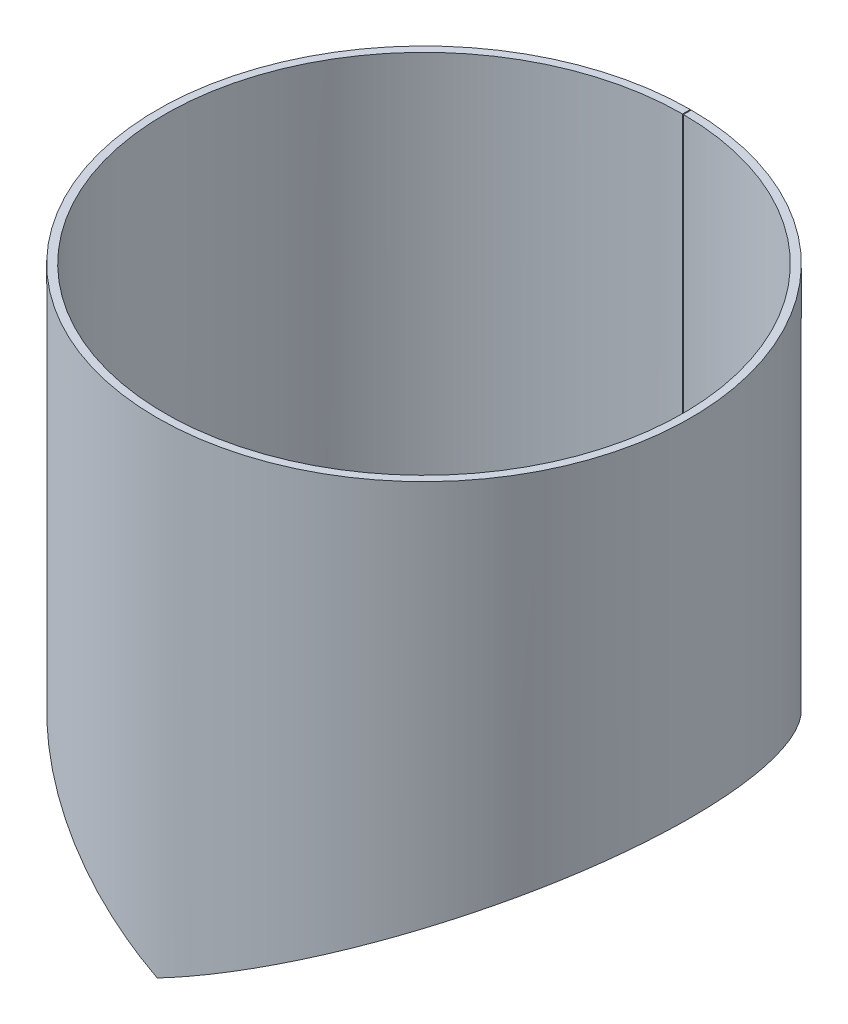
ISO-10303-21;
HEADER;
FILE_DESCRIPTION(('STEP AP214'),'2;1');
FILE_NAME('part.step','',(''),(''),'','','');
FILE_SCHEMA(('AUTOMOTIVE_DESIGN { 1 0 10303 214 1 1 1 1 }'));
ENDSEC;
DATA;
#1=APPLICATION_CONTEXT('core data for automotive mechanical design processes');
#2=APPLICATION_PROTOCOL_DEFINITION('international standard','automotive_design',2000,#1);
#3=PRODUCT_CONTEXT('',#1,'mechanical');
#4=PRODUCT('Part','Part','',(#3));
#5=PRODUCT_RELATED_PRODUCT_CATEGORY('part','',(#4));
#6=PRODUCT_DEFINITION_FORMATION('','',#4);
#7=PRODUCT_DEFINITION_CONTEXT('part definition',#1,'design');
#8=PRODUCT_DEFINITION('design','',#6,#7);
#9=PRODUCT_DEFINITION_SHAPE('','',#8);
#10=(LENGTH_UNIT() NAMED_UNIT(*) SI_UNIT(.MILLI.,.METRE.));
#11=(NAMED_UNIT(*) PLANE_ANGLE_UNIT() SI_UNIT($,.RADIAN.));
#12=(NAMED_UNIT(*) SI_UNIT($,.STERADIAN.) SOLID_ANGLE_UNIT());
#13=UNCERTAINTY_MEASURE_WITH_UNIT(LENGTH_MEASURE(1.E-05),#10,'distance_accuracy_value','');
#14=(GEOMETRIC_REPRESENTATION_CONTEXT(3) GLOBAL_UNCERTAINTY_ASSIGNED_CONTEXT((#13)) GLOBAL_UNIT_ASSIGNED_CONTEXT((#10,
#11,#12)) REPRESENTATION_CONTEXT('',''));
#15=CARTESIAN_POINT('',(0.,0.,0.));
#16=DIRECTION('',(0.,0.,1.));
#17=DIRECTION('',(1.,0.,0.));
#18=AXIS2_PLACEMENT_3D('',#15,#16,#17);
#19=CARTESIAN_POINT('',(-0.500000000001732,0.26028352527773,-274.99954545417));
#20=CARTESIAN_POINT('',(-5.19580289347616,2.70476129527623,-274.991007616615));
#21=CARTESIAN_POINT('',(-8.95442377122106,4.66126304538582,-274.868684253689));
#22=CARTESIAN_POINT('',(-12.1285718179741,6.31371606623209,-274.732637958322));
#23=CARTESIAN_POINT('',(-12.466617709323,6.48970068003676,-274.717469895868));
#24=CARTESIAN_POINT('',(-13.1134449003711,6.82642735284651,-274.687353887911));
#25=CARTESIAN_POINT('',(-13.420145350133,6.98608502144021,-274.672523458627));
#26=CARTESIAN_POINT('',(-14.3458117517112,7.467955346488,-274.626254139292));
#27=CARTESIAN_POINT('',(-14.9549103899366,7.78502790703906,-274.593723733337));
#28=CARTESIAN_POINT('',(-16.7581542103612,8.72372262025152,-274.491555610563));
#29=CARTESIAN_POINT('',(-17.9282456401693,9.33282180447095,-274.417345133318));
#30=CARTESIAN_POINT('',(-21.3422489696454,11.1100274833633,-274.180075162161));
#31=CARTESIAN_POINT('',(-23.489869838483,12.2280421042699,-274.002443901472));
#32=CARTESIAN_POINT('',(-26.5189252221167,13.804880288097,-273.720249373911));
#33=CARTESIAN_POINT('',(-27.5082927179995,14.3198984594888,-273.622494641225));
#34=CARTESIAN_POINT('',(-29.4732545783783,15.3427411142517,-273.417817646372));
#35=CARTESIAN_POINT('',(-30.4446736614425,15.8483942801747,-273.311280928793));
#36=CARTESIAN_POINT('',(-35.2463678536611,18.3478193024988,-272.759316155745));
#37=CARTESIAN_POINT('',(-38.910327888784,20.2550687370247,-272.25619699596));
#38=CARTESIAN_POINT('',(-44.1398222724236,22.9775070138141,-271.440212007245));
#39=CARTESIAN_POINT('',(-45.8386019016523,23.8619137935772,-271.157968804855));
#40=CARTESIAN_POINT('',(-49.1475699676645,25.584582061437,-270.577785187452));
#41=CARTESIAN_POINT('',(-50.7501100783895,26.4188425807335,-270.281357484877));
#42=CARTESIAN_POINT('',(-58.6435328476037,30.527824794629,-268.751390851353));
#43=CARTESIAN_POINT('',(-64.6354007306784,33.6468450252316,-267.360507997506));
#44=CARTESIAN_POINT('',(-73.1378396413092,38.0731270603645,-265.112146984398));
#45=CARTESIAN_POINT('',(-75.8810699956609,39.5011869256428,-264.338719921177));
#46=CARTESIAN_POINT('',(-81.2666255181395,42.3046200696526,-262.733003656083));
#47=CARTESIAN_POINT('',(-83.9093953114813,43.680285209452,-261.900120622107));
#48=CARTESIAN_POINT('',(-91.6872704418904,47.7291263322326,-259.322740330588));
#49=CARTESIAN_POINT('',(-96.6640511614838,50.320119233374,-257.502738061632));
#50=CARTESIAN_POINT('',(-106.251209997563,55.3109388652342,-253.697219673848));
#51=CARTESIAN_POINT('',(-110.898730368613,57.7301528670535,-251.696363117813));
#52=CARTESIAN_POINT('',(-119.900482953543,62.416189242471,-247.534768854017));
#53=CARTESIAN_POINT('',(-124.246493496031,64.678638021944,-245.378599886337));
#54=CARTESIAN_POINT('',(-132.699120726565,69.0786958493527,-240.912415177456));
#55=CARTESIAN_POINT('',(-136.804323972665,71.2157137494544,-238.602362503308));
#56=CARTESIAN_POINT('',(-144.772396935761,75.3637275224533,-233.853508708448));
#57=CARTESIAN_POINT('',(-148.631482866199,77.3726392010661,-231.417519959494));
#58=CARTESIAN_POINT('',(-156.148422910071,81.2856312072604,-226.413463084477));
#59=CARTESIAN_POINT('',(-159.801999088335,83.1875696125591,-223.84767233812));
#60=CARTESIAN_POINT('',(-166.899411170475,86.8823312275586,-218.607058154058));
#61=CARTESIAN_POINT('',(-170.341236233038,88.674021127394,-215.93409905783));
#62=CARTESIAN_POINT('',(-177.041449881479,92.161865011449,-210.475644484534));
#63=CARTESIAN_POINT('',(-180.29687569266,93.8565345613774,-207.692173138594));
#64=CARTESIAN_POINT('',(-186.61837922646,97.1473688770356,-202.031142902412));
#65=CARTESIAN_POINT('',(-189.68198582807,98.7422218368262,-199.156177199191));
#66=CARTESIAN_POINT('',(-195.641632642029,101.844303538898,-193.304915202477));
#67=CARTESIAN_POINT('',(-198.535726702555,103.350630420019,-190.330135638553));
#68=CARTESIAN_POINT('',(-206.95972360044,107.73546915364,-181.27507838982));
#69=CARTESIAN_POINT('',(-212.231040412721,110.479839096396,-175.064240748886));
#70=CARTESIAN_POINT('',(-222.086093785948,115.61086722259,-162.380016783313));
#71=CARTESIAN_POINT('',(-226.666629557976,117.995073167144,-155.912824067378));
#72=CARTESIAN_POINT('',(-235.188001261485,122.431146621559,-142.734626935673));
#73=CARTESIAN_POINT('',(-239.121101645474,124.478512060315,-136.034646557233));
#74=CARTESIAN_POINT('',(-249.980234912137,130.131343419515,-115.638174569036));
#75=CARTESIAN_POINT('',(-255.960678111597,133.244696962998,-101.656963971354));
#76=CARTESIAN_POINT('',(-263.114571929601,136.968777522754,-80.3241794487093));
#77=CARTESIAN_POINT('',(-265.196884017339,138.052630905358,-73.1501271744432));
#78=CARTESIAN_POINT('',(-268.763416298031,139.909373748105,-58.7073628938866));
#79=CARTESIAN_POINT('',(-270.246653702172,140.681388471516,-51.4444899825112));
#80=CARTESIAN_POINT('',(-273.810787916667,142.535885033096,-29.5264282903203));
#81=CARTESIAN_POINT('',(-274.997652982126,143.154679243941,-14.7640975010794));
#82=CARTESIAN_POINT('',(-275.00234004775,143.157194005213,14.6765353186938));
#83=CARTESIAN_POINT('',(-273.820375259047,142.540848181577,29.4377470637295));
#84=CARTESIAN_POINT('',(-270.263110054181,140.689920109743,51.3580184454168));
#85=CARTESIAN_POINT('',(-268.782117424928,139.919119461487,58.6216735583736));
#86=CARTESIAN_POINT('',(-265.220230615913,138.064790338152,73.0654263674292));
#87=CARTESIAN_POINT('',(-263.139955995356,136.981972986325,80.2409796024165));
#88=CARTESIAN_POINT('',(-255.992843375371,133.261482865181,101.575927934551));
#89=CARTESIAN_POINT('',(-250.016440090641,130.150218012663,115.56011030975));
#90=CARTESIAN_POINT('',(-239.162311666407,124.49994969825,135.962232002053));
#91=CARTESIAN_POINT('',(-235.231058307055,122.453576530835,142.663705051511));
#92=CARTESIAN_POINT('',(-226.712659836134,118.019030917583,155.845928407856));
#93=CARTESIAN_POINT('',(-222.133589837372,115.635620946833,162.315063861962));
#94=CARTESIAN_POINT('',(-212.281550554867,110.506172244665,175.003014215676));
#95=CARTESIAN_POINT('',(-207.01127866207,107.762304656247,181.216283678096));
#96=CARTESIAN_POINT('',(-198.587955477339,103.377788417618,190.275659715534));
#97=CARTESIAN_POINT('',(-195.693937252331,101.871497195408,193.251990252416));
#98=CARTESIAN_POINT('',(-189.734114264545,98.7693431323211,199.106541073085));
#99=CARTESIAN_POINT('',(-186.670750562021,97.1746375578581,201.982763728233));
#100=CARTESIAN_POINT('',(-180.350040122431,93.8842141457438,207.646018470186));
#101=CARTESIAN_POINT('',(-177.094795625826,92.1896314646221,210.430780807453));
#102=CARTESIAN_POINT('',(-170.394466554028,88.7017241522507,215.892116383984));
#103=CARTESIAN_POINT('',(-166.952664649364,86.9100591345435,218.566398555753));
#104=CARTESIAN_POINT('',(-159.855886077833,83.2156266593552,223.809201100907));
#105=CARTESIAN_POINT('',(-156.20231569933,81.3136822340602,226.376307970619));
#106=CARTESIAN_POINT('',(-148.684704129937,77.4003370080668,231.383350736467));
#107=CARTESIAN_POINT('',(-144.82555687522,75.391408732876,233.820597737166));
#108=CARTESIAN_POINT('',(-136.857927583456,71.2436224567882,238.571627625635));
#109=CARTESIAN_POINT('',(-132.752462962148,69.1064571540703,240.883054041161));
#110=CARTESIAN_POINT('',(-124.298264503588,64.7055822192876,245.352406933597));
#111=CARTESIAN_POINT('',(-119.952775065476,62.4434162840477,247.509460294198));
#112=CARTESIAN_POINT('',(-110.949396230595,57.7565088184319,251.674060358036));
#113=CARTESIAN_POINT('',(-106.299707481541,55.3361514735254,253.676989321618));
#114=CARTESIAN_POINT('',(-99.1039189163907,51.5902600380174,256.534742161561));
#115=CARTESIAN_POINT('',(-96.6654385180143,50.3207940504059,257.464241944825));
#116=CARTESIAN_POINT('',(-91.678663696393,47.724719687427,259.281826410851));
#117=CARTESIAN_POINT('',(-89.1345405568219,46.4002929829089,260.168229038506));
#118=CARTESIAN_POINT('',(-83.9447034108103,43.6986605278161,261.888832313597));
#119=CARTESIAN_POINT('',(-81.298988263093,42.3214547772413,262.723032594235));
#120=CARTESIAN_POINT('',(-75.9062074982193,39.5142642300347,264.33154373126));
#121=CARTESIAN_POINT('',(-73.1622974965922,38.085870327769,265.105418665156));
#122=CARTESIAN_POINT('',(-64.6547526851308,33.6569296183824,267.355909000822));
#123=CARTESIAN_POINT('',(-58.6549438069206,30.5337401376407,268.749209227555));
#124=CARTESIAN_POINT('',(-50.7457078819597,26.4165503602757,270.282203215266));
#125=CARTESIAN_POINT('',(-49.1449674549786,25.5832421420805,270.578256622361));
#126=CARTESIAN_POINT('',(-45.8363975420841,23.8607868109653,271.158340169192));
#127=CARTESIAN_POINT('',(-44.136751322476,22.9759246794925,271.440724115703));
#128=CARTESIAN_POINT('',(-38.9014311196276,20.2504348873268,272.257519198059));
#129=CARTESIAN_POINT('',(-35.2292834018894,18.338903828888,272.761701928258));
#130=CARTESIAN_POINT('',(-29.4484302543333,15.3298004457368,273.425587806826));
#131=CARTESIAN_POINT('',(-27.4760623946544,14.3031315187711,273.63145278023));
#132=CARTESIAN_POINT('',(-23.4408345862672,12.2025247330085,274.006629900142));
#133=CARTESIAN_POINT('',(-21.2937200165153,11.084766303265,274.183913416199));
#134=CARTESIAN_POINT('',(-17.8679864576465,9.30144915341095,274.4212915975));
#135=CARTESIAN_POINT('',(-16.6924865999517,8.68953350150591,274.495587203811));
#136=CARTESIAN_POINT('',(-14.87887906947,7.74544512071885,274.597861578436));
#137=CARTESIAN_POINT('',(-14.2659507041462,7.42637984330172,274.630423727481));
#138=CARTESIAN_POINT('',(-13.0233187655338,6.77951098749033,274.692155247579));
#139=CARTESIAN_POINT('',(-12.409072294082,6.45975536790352,274.720774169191));
#140=CARTESIAN_POINT('',(-8.91640541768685,4.64148783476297,274.869640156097));
#141=CARTESIAN_POINT('',(-5.01297482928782,2.60958808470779,275.));
#142=CARTESIAN_POINT('',(2.95550867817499E-12,2.33907962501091E-12,275.));
#143=CARTESIAN_POINT('',(-0.485454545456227,0.26028352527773,-266.999558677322));
#144=CARTESIAN_POINT('',(-5.04464970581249,2.70475992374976,-266.991269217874));
#145=CARTESIAN_POINT('',(-8.693931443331,4.66126304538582,-266.872504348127));
#146=CARTESIAN_POINT('',(-11.7757406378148,6.31371606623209,-266.74041576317));
#147=CARTESIAN_POINT('',(-12.10395246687,6.48970068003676,-266.725688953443));
#148=CARTESIAN_POINT('',(-12.7319628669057,6.82642735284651,-266.696449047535));
#149=CARTESIAN_POINT('',(-13.0297411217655,6.98608502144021,-266.682050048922));
#150=CARTESIAN_POINT('',(-13.9284790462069,7.467955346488,-266.637126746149));
#151=CARTESIAN_POINT('',(-14.5198584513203,7.78502790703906,-266.605542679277));
#152=CARTESIAN_POINT('',(-16.2706442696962,8.72372262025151,-266.506346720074));
#153=CARTESIAN_POINT('',(-17.4066966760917,9.33282180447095,-266.434295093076));
#154=CARTESIAN_POINT('',(-20.7213835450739,11.1100274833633,-266.20392752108));
#155=CARTESIAN_POINT('',(-22.8065281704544,12.2280421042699,-266.031463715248));
#156=CARTESIAN_POINT('',(-25.7474655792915,13.804880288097,-265.757478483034));
#157=CARTESIAN_POINT('',(-26.7080514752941,14.3198984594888,-265.66256752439));
#158=CARTESIAN_POINT('',(-28.6158508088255,15.3427411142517,-265.463844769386));
#159=CARTESIAN_POINT('',(-29.5590104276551,15.8483942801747,-265.360407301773));
#160=CARTESIAN_POINT('',(-34.2210189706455,18.3478193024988,-264.824499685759));
#161=CARTESIAN_POINT('',(-37.7783910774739,20.2550687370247,-264.336016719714));
#162=CARTESIAN_POINT('',(-42.8557547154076,22.9775070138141,-263.543769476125));
#163=CARTESIAN_POINT('',(-44.5051153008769,23.8619137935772,-263.269736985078));
#164=CARTESIAN_POINT('',(-47.7178224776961,25.584582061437,-262.706431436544));
#165=CARTESIAN_POINT('',(-49.2737432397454,26.4188425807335,-262.418627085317));
#166=CARTESIAN_POINT('',(-56.9375391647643,30.527824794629,-260.933168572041));
#167=CARTESIAN_POINT('',(-62.7550981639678,33.6468450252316,-259.582747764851));
#168=CARTESIAN_POINT('',(-71.0101933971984,38.0731270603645,-257.39979361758));
#169=CARTESIAN_POINT('',(-73.6736206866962,39.5011869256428,-256.648866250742));
#170=CARTESIAN_POINT('',(-78.9025055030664,42.3046200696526,-255.089861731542));
#171=CARTESIAN_POINT('',(-81.4683947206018,43.680285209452,-254.281208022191));
#172=CARTESIAN_POINT('',(-89.0200043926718,47.7291263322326,-251.778806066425));
#173=CARTESIAN_POINT('',(-93.8520060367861,50.320119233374,-250.01174931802));
#174=CARTESIAN_POINT('',(-103.160265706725,55.3109388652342,-246.3169369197));
#175=CARTESIAN_POINT('',(-107.672585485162,57.7301528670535,-244.37428709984));
#176=CARTESIAN_POINT('',(-116.412468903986,62.416189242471,-240.333757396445));
#177=CARTESIAN_POINT('',(-120.632050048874,64.678638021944,-238.240313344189));
#178=CARTESIAN_POINT('',(-128.838782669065,69.0786958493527,-233.904054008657));
#179=CARTESIAN_POINT('',(-132.824561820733,71.2157137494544,-231.661202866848));
#180=CARTESIAN_POINT('',(-140.56083629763,75.3637275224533,-227.05049754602));
#181=CARTESIAN_POINT('',(-144.307657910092,77.3726392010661,-224.685373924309));
#182=CARTESIAN_POINT('',(-151.605923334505,81.2856312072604,-219.826889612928));
#183=CARTESIAN_POINT('',(-155.153213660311,83.1875696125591,-217.33574005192));
#184=CARTESIAN_POINT('',(-162.044155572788,86.8823312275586,-212.247580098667));
#185=CARTESIAN_POINT('',(-165.385854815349,88.674021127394,-209.652379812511));
#186=CARTESIAN_POINT('',(-171.891153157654,92.161865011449,-204.352716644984));
#187=CARTESIAN_POINT('',(-175.05187567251,93.8565345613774,-201.650219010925));
#188=CARTESIAN_POINT('',(-181.18948092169,97.1473688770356,-196.153873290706));
#189=CARTESIAN_POINT('',(-184.163964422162,98.7422218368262,-193.362542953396));
#190=CARTESIAN_POINT('',(-189.950239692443,101.844303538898,-187.681499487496));
#191=CARTESIAN_POINT('',(-192.760141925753,103.350630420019,-184.793258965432));
#192=CARTESIAN_POINT('',(-200.9390770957,107.73546915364,-176.001621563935));
#193=CARTESIAN_POINT('',(-206.057046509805,110.479839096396,-169.971462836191));
#194=CARTESIAN_POINT('',(-215.625407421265,115.61086722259,-157.656234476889));
#195=CARTESIAN_POINT('',(-220.072691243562,117.995073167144,-151.377178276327));
#196=CARTESIAN_POINT('',(-228.346168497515,122.431146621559,-138.582346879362));
#197=CARTESIAN_POINT('',(-232.164851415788,124.478512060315,-132.077275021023));
#198=CARTESIAN_POINT('',(-242.708082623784,130.131343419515,-112.27415494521));
#199=CARTESIAN_POINT('',(-248.514549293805,133.244696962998,-98.6996704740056));
#200=CARTESIAN_POINT('',(-255.460329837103,136.968777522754,-77.9874760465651));
#201=CARTESIAN_POINT('',(-257.482065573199,138.052630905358,-71.022123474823));
#202=CARTESIAN_POINT('',(-260.944844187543,139.909373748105,-56.9995123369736));
#203=CARTESIAN_POINT('',(-262.3849328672,140.681388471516,-49.9479230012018));
#204=CARTESIAN_POINT('',(-265.845383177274,142.535885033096,-28.6674776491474));
#205=CARTESIAN_POINT('',(-266.99772125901,143.154679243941,-14.3345964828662));
#206=CARTESIAN_POINT('',(-267.002271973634,143.157194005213,14.2495815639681));
#207=CARTESIAN_POINT('',(-265.854691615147,142.540848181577,28.5813762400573));
#208=CARTESIAN_POINT('',(-262.400910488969,140.689920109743,49.8639669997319));
#209=CARTESIAN_POINT('',(-260.963001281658,139.919119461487,56.91631578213));
#210=CARTESIAN_POINT('',(-257.504732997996,138.064790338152,70.9398866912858));
#211=CARTESIAN_POINT('',(-255.484975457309,136.981972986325,77.9066965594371));
#212=CARTESIAN_POINT('',(-248.545778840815,133.261482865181,98.6209918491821));
#213=CARTESIAN_POINT('',(-242.743234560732,130.150218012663,112.198361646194));
#214=CARTESIAN_POINT('',(-232.204862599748,124.49994969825,132.006967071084));
#215=CARTESIAN_POINT('',(-228.387972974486,122.453576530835,138.513488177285));
#216=CARTESIAN_POINT('',(-220.117382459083,118.019030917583,151.312228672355));
#217=CARTESIAN_POINT('',(-215.671521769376,115.635620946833,157.593171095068));
#218=CARTESIAN_POINT('',(-206.106087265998,110.506172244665,169.912017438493));
#219=CARTESIAN_POINT('',(-200.989132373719,107.762304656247,175.944537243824));
#220=CARTESIAN_POINT('',(-192.810851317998,103.377788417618,184.740367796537));
#221=CARTESIAN_POINT('',(-190.001022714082,101.871497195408,187.630114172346));
#222=CARTESIAN_POINT('',(-184.214576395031,98.7693431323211,193.314350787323));
#223=CARTESIAN_POINT('',(-181.240328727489,97.1746375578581,196.106901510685));
#224=CARTESIAN_POINT('',(-175.103493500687,93.8842141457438,201.605407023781));
#225=CARTESIAN_POINT('',(-171.942947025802,92.1896314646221,204.309158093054));
#226=CARTESIAN_POINT('',(-165.43753661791,88.7017241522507,209.611618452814));
#227=CARTESIAN_POINT('',(-162.095859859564,86.9100591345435,212.20810332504));
#228=CARTESIAN_POINT('',(-155.205533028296,83.2156266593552,217.298387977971));
#229=CARTESIAN_POINT('',(-151.658248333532,81.3136822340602,219.79081537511));
#230=CARTESIAN_POINT('',(-144.359330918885,77.4003370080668,224.652198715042));
#231=CARTESIAN_POINT('',(-140.612449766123,75.391408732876,227.018543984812));
#232=CARTESIAN_POINT('',(-132.876606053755,71.2436224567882,231.631362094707));
#233=CARTESIAN_POINT('',(-128.890573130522,69.1064571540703,233.875547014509));
#234=CARTESIAN_POINT('',(-120.682314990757,64.7055822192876,238.214882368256));
#235=CARTESIAN_POINT('',(-116.463239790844,62.4434162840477,240.30918508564));
#236=CARTESIAN_POINT('',(-107.721777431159,57.7565088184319,244.352633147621));
#237=CARTESIAN_POINT('',(-103.207352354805,55.3361514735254,246.297295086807));
#238=CARTESIAN_POINT('',(-96.2208958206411,51.5902600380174,249.07191329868));
#239=CARTESIAN_POINT('',(-93.8533530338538,50.3207940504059,249.974373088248));
#240=CARTESIAN_POINT('',(-89.0116480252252,47.724719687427,251.739082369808));
#241=CARTESIAN_POINT('',(-86.5415357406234,46.4002929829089,252.599698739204));
#242=CARTESIAN_POINT('',(-81.5026756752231,43.6986605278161,254.270248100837));
#243=CARTESIAN_POINT('',(-78.9339267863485,42.3214547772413,255.080180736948));
#244=CARTESIAN_POINT('',(-73.698026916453,39.5142642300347,256.641898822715));
#245=CARTESIAN_POINT('',(-71.0339397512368,38.085870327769,257.393261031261));
#246=CARTESIAN_POINT('',(-62.7738871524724,33.6569296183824,259.578282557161));
#247=CARTESIAN_POINT('',(-56.9486181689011,30.5337401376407,260.931050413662));
#248=CARTESIAN_POINT('',(-49.2694691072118,26.4165503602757,262.41944821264));
#249=CARTESIAN_POINT('',(-47.7152956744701,25.5832421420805,262.706889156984));
#250=CARTESIAN_POINT('',(-44.5029750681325,23.8607868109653,263.270097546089));
#251=CARTESIAN_POINT('',(-42.8527731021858,22.9759246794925,263.544266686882));
#252=CARTESIAN_POINT('',(-37.7697531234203,20.2504348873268,264.337300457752));
#253=CARTESIAN_POINT('',(-34.2044315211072,18.338903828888,264.826816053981));
#254=CARTESIAN_POINT('',(-28.5917486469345,15.3298004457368,265.471388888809));
#255=CARTESIAN_POINT('',(-26.6767587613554,14.3031315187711,265.671265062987));
#256=CARTESIAN_POINT('',(-22.758919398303,12.2025247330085,266.035527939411));
#257=CARTESIAN_POINT('',(-20.6742663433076,11.084766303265,266.207654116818));
#258=CARTESIAN_POINT('',(-17.3481904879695,9.30144915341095,266.438126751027));
#259=CARTESIAN_POINT('',(-16.2068869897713,8.68953350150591,266.510261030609));
#260=CARTESIAN_POINT('',(-14.4460389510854,7.74544512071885,266.609560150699));
#261=CARTESIAN_POINT('',(-13.8509412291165,7.42637984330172,266.641175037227));
#262=CARTESIAN_POINT('',(-12.6444585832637,6.77951098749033,266.701110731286));
#263=CARTESIAN_POINT('',(-12.0480811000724,6.45975536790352,266.728897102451));
#264=CARTESIAN_POINT('',(-8.65701907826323,4.64148783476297,266.873432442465));
#265=CARTESIAN_POINT('',(-4.86713962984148,2.60958636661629,267.));
#266=CARTESIAN_POINT('',(2.86926383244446E-12,2.33907962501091E-12,267.));
#267=B_SPLINE_SURFACE_WITH_KNOTS('',1,3,((#19,#20,#21,#22,#23,#24,#25,#26,#27,#28,#29,#30,#31,
#32,#33,#34,#35,#36,#37,#38,#39,#40,#41,#42,#43,#44,#45,#46,#47,#48,#49,#50,#51,#52,#53,#54,#55,
#56,#57,#58,#59,#60,#61,#62,#63,#64,#65,#66,#67,#68,#69,#70,#71,#72,#73,#74,#75,#76,#77,#78,#79,
#80,#81,#82,#83,#84,#85,#86,#87,#88,#89,#90,#91,#92,#93,#94,#95,#96,#97,#98,#99,#100,#101,#102,
#103,#104,#105,#106,#107,#108,#109,#110,#111,#112,#113,#114,#115,#116,#117,#118,#119,#120,#121,
#122,#123,#124,#125,#126,#127,#128,#129,#130,#131,#132,#133,#134,#135,#136,#137,#138,#139,#140,
#141,#142),(#143,#144,#145,#146,#147,#148,#149,#150,#151,#152,#153,#154,#155,#156,#157,#158,
#159,#160,#161,#162,#163,#164,#165,#166,#167,#168,#169,#170,#171,#172,#173,#174,#175,#176,#177,
#178,#179,#180,#181,#182,#183,#184,#185,#186,#187,#188,#189,#190,#191,#192,#193,#194,#195,#196,
#197,#198,#199,#200,#201,#202,#203,#204,#205,#206,#207,#208,#209,#210,#211,#212,#213,#214,#215,
#216,#217,#218,#219,#220,#221,#222,#223,#224,#225,#226,#227,#228,#229,#230,#231,#232,#233,#234,
#235,#236,#237,#238,#239,#240,#241,#242,#243,#244,#245,#246,#247,#248,#249,#250,#251,#252,#253,
#254,#255,#256,#257,#258,#259,#260,#261,#262,#263,#264,#265,#266)),.UNSPECIFIED.,.F.,.F.,.F.,(2,
2),(4,2,2,2,2,2,2,2,2,2,2,2,2,2,2,2,2,2,2,2,2,2,2,2,2,2,2,2,2,2,2,2,2,2,2,2,2,2,2,2,2,2,2,2,2,2,
2,2,2,2,2,2,2,2,2,2,2,2,2,2,2,4),(0.,1.),(0.,0.00390625,0.00439453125,0.0048828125,0.005859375,
0.0078125,0.01171875,0.013671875,0.015625,0.0234375,0.02734375,0.03125,0.046875,0.0546875,
0.0625,0.078125,0.09375,0.109375,0.125,0.140625,0.15625,0.171875,0.1875,0.203125,0.21875,0.25,
0.28125,0.3125,0.375,0.40625,0.4375,0.5,0.5625,0.59375,0.625,0.6875,0.71875,0.75,0.78125,
0.796875,0.8125,0.828125,0.84375,0.859375,0.875,0.890625,0.90625,0.921875,0.9296875,0.9375,
0.9453125,0.953125,0.96875,0.97265625,0.9765625,0.984375,0.98828125,0.9921875,0.994140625,
0.9951171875,0.99609375,1.),.UNSPECIFIED.);
#268=CARTESIAN_POINT('',(-0.500000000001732,0.26028352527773,-274.99954545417));
#269=CARTESIAN_POINT('',(-0.485454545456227,0.26028352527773,-266.999558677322));
#270=B_SPLINE_CURVE_WITH_KNOTS('',1,(#268,#269),.UNSPECIFIED.,.F.,.F.,(2,2),(0.,1.),.UNSPECIFIED.);
#271=CARTESIAN_POINT('',(-0.485454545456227,0.26028352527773,-266.999558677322));
#272=VERTEX_POINT('',#271);
#273=CARTESIAN_POINT('',(-0.500000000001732,0.260283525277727,-274.99954545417));
#274=VERTEX_POINT('',#273);
#275=EDGE_CURVE('E13',#272,#274,#270,.F.);
#276=CARTESIAN_POINT('',(-0.485454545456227,0.26028352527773,-266.999558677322));
#277=CARTESIAN_POINT('',(-5.04464970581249,2.70475992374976,-266.991269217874));
#278=CARTESIAN_POINT('',(-8.693931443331,4.66126304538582,-266.872504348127));
#279=CARTESIAN_POINT('',(-11.7757406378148,6.31371606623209,-266.74041576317));
#280=CARTESIAN_POINT('',(-12.10395246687,6.48970068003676,-266.725688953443));
#281=CARTESIAN_POINT('',(-12.7319628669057,6.82642735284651,-266.696449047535));
#282=CARTESIAN_POINT('',(-13.0297411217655,6.98608502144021,-266.682050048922));
#283=CARTESIAN_POINT('',(-13.9284790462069,7.467955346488,-266.637126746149));
#284=CARTESIAN_POINT('',(-14.5198584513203,7.78502790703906,-266.605542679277));
#285=CARTESIAN_POINT('',(-16.2706442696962,8.72372262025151,-266.506346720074));
#286=CARTESIAN_POINT('',(-17.4066966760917,9.33282180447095,-266.434295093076));
#287=CARTESIAN_POINT('',(-20.7213835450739,11.1100274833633,-266.20392752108));
#288=CARTESIAN_POINT('',(-22.8065281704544,12.2280421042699,-266.031463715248));
#289=CARTESIAN_POINT('',(-25.7474655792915,13.804880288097,-265.757478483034));
#290=CARTESIAN_POINT('',(-26.7080514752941,14.3198984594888,-265.66256752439));
#291=CARTESIAN_POINT('',(-28.6158508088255,15.3427411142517,-265.463844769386));
#292=CARTESIAN_POINT('',(-29.5590104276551,15.8483942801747,-265.360407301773));
#293=CARTESIAN_POINT('',(-34.2210189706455,18.3478193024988,-264.824499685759));
#294=CARTESIAN_POINT('',(-37.7783910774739,20.2550687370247,-264.336016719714));
#295=CARTESIAN_POINT('',(-42.8557547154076,22.9775070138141,-263.543769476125));
#296=CARTESIAN_POINT('',(-44.5051153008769,23.8619137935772,-263.269736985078));
#297=CARTESIAN_POINT('',(-47.7178224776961,25.584582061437,-262.706431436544));
#298=CARTESIAN_POINT('',(-49.2737432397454,26.4188425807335,-262.418627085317));
#299=CARTESIAN_POINT('',(-56.9375391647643,30.527824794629,-260.933168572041));
#300=CARTESIAN_POINT('',(-62.7550981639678,33.6468450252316,-259.582747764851));
#301=CARTESIAN_POINT('',(-71.0101933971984,38.0731270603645,-257.39979361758));
#302=CARTESIAN_POINT('',(-73.6736206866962,39.5011869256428,-256.648866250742));
#303=CARTESIAN_POINT('',(-78.9025055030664,42.3046200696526,-255.089861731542));
#304=CARTESIAN_POINT('',(-81.4683947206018,43.680285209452,-254.281208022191));
#305=CARTESIAN_POINT('',(-89.0200043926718,47.7291263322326,-251.778806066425));
#306=CARTESIAN_POINT('',(-93.8520060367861,50.320119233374,-250.01174931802));
#307=CARTESIAN_POINT('',(-103.160265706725,55.3109388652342,-246.3169369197));
#308=CARTESIAN_POINT('',(-107.672585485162,57.7301528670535,-244.37428709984));
#309=CARTESIAN_POINT('',(-116.412468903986,62.416189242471,-240.333757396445));
#310=CARTESIAN_POINT('',(-120.632050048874,64.678638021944,-238.240313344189));
#311=CARTESIAN_POINT('',(-128.838782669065,69.0786958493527,-233.904054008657));
#312=CARTESIAN_POINT('',(-132.824561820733,71.2157137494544,-231.661202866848));
#313=CARTESIAN_POINT('',(-140.56083629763,75.3637275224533,-227.05049754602));
#314=CARTESIAN_POINT('',(-144.307657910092,77.3726392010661,-224.685373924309));
#315=CARTESIAN_POINT('',(-151.605923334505,81.2856312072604,-219.826889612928));
#316=CARTESIAN_POINT('',(-155.153213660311,83.1875696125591,-217.33574005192));
#317=CARTESIAN_POINT('',(-162.044155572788,86.8823312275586,-212.247580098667));
#318=CARTESIAN_POINT('',(-165.385854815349,88.674021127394,-209.652379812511));
#319=CARTESIAN_POINT('',(-171.891153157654,92.161865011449,-204.352716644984));
#320=CARTESIAN_POINT('',(-175.05187567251,93.8565345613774,-201.650219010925));
#321=CARTESIAN_POINT('',(-181.18948092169,97.1473688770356,-196.153873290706));
#322=CARTESIAN_POINT('',(-184.163964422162,98.7422218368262,-193.362542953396));
#323=CARTESIAN_POINT('',(-189.950239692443,101.844303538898,-187.681499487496));
#324=CARTESIAN_POINT('',(-192.760141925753,103.350630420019,-184.793258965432));
#325=CARTESIAN_POINT('',(-200.9390770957,107.73546915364,-176.001621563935));
#326=CARTESIAN_POINT('',(-206.057046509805,110.479839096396,-169.971462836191));
#327=CARTESIAN_POINT('',(-215.625407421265,115.61086722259,-157.656234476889));
#328=CARTESIAN_POINT('',(-220.072691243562,117.995073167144,-151.377178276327));
#329=CARTESIAN_POINT('',(-228.346168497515,122.431146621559,-138.582346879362));
#330=CARTESIAN_POINT('',(-232.164851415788,124.478512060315,-132.077275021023));
#331=CARTESIAN_POINT('',(-242.708082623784,130.131343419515,-112.27415494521));
#332=CARTESIAN_POINT('',(-248.514549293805,133.244696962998,-98.6996704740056));
#333=CARTESIAN_POINT('',(-255.460329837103,136.968777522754,-77.9874760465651));
#334=CARTESIAN_POINT('',(-257.482065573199,138.052630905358,-71.022123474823));
#335=CARTESIAN_POINT('',(-260.944844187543,139.909373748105,-56.9995123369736));
#336=CARTESIAN_POINT('',(-262.3849328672,140.681388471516,-49.9479230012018));
#337=CARTESIAN_POINT('',(-265.845383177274,142.535885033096,-28.6674776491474));
#338=CARTESIAN_POINT('',(-266.99772125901,143.154679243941,-14.3345964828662));
#339=CARTESIAN_POINT('',(-267.002271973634,143.157194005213,14.2495815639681));
#340=CARTESIAN_POINT('',(-265.854691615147,142.540848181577,28.5813762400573));
#341=CARTESIAN_POINT('',(-262.400910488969,140.689920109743,49.8639669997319));
#342=CARTESIAN_POINT('',(-260.963001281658,139.919119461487,56.91631578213));
#343=CARTESIAN_POINT('',(-257.504732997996,138.064790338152,70.9398866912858));
#344=CARTESIAN_POINT('',(-255.484975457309,136.981972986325,77.9066965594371));
#345=CARTESIAN_POINT('',(-248.545778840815,133.261482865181,98.6209918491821));
#346=CARTESIAN_POINT('',(-242.743234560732,130.150218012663,112.198361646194));
#347=CARTESIAN_POINT('',(-232.204862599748,124.49994969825,132.006967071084));
#348=CARTESIAN_POINT('',(-228.387972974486,122.453576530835,138.513488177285));
#349=CARTESIAN_POINT('',(-220.117382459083,118.019030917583,151.312228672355));
#350=CARTESIAN_POINT('',(-215.671521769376,115.635620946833,157.593171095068));
#351=CARTESIAN_POINT('',(-206.106087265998,110.506172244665,169.912017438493));
#352=CARTESIAN_POINT('',(-200.989132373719,107.762304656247,175.944537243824));
#353=CARTESIAN_POINT('',(-192.810851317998,103.377788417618,184.740367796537));
#354=CARTESIAN_POINT('',(-190.001022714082,101.871497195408,187.630114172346));
#355=CARTESIAN_POINT('',(-184.214576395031,98.7693431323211,193.314350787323));
#356=CARTESIAN_POINT('',(-181.240328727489,97.1746375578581,196.106901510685));
#357=CARTESIAN_POINT('',(-175.103493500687,93.8842141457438,201.605407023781));
#358=CARTESIAN_POINT('',(-171.942947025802,92.1896314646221,204.309158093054));
#359=CARTESIAN_POINT('',(-165.43753661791,88.7017241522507,209.611618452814));
#360=CARTESIAN_POINT('',(-162.095859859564,86.9100591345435,212.20810332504));
#361=CARTESIAN_POINT('',(-155.205533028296,83.2156266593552,217.298387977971));
#362=CARTESIAN_POINT('',(-151.658248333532,81.3136822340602,219.79081537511));
#363=CARTESIAN_POINT('',(-144.359330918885,77.4003370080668,224.652198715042));
#364=CARTESIAN_POINT('',(-140.612449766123,75.391408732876,227.018543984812));
#365=CARTESIAN_POINT('',(-132.876606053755,71.2436224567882,231.631362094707));
#366=CARTESIAN_POINT('',(-128.890573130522,69.1064571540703,233.875547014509));
#367=CARTESIAN_POINT('',(-120.682314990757,64.7055822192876,238.214882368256));
#368=CARTESIAN_POINT('',(-116.463239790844,62.4434162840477,240.30918508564));
#369=CARTESIAN_POINT('',(-107.721777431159,57.7565088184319,244.352633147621));
#370=CARTESIAN_POINT('',(-103.207352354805,55.3361514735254,246.297295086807));
#371=CARTESIAN_POINT('',(-96.2208958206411,51.5902600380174,249.07191329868));
#372=CARTESIAN_POINT('',(-93.8533530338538,50.3207940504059,249.974373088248));
#373=CARTESIAN_POINT('',(-89.0116480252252,47.724719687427,251.739082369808));
#374=CARTESIAN_POINT('',(-86.5415357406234,46.4002929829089,252.599698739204));
#375=CARTESIAN_POINT('',(-81.5026756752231,43.6986605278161,254.270248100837));
#376=CARTESIAN_POINT('',(-78.9339267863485,42.3214547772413,255.080180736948));
#377=CARTESIAN_POINT('',(-73.698026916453,39.5142642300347,256.641898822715));
#378=CARTESIAN_POINT('',(-71.0339397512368,38.085870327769,257.393261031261));
#379=CARTESIAN_POINT('',(-62.7738871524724,33.6569296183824,259.578282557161));
#380=CARTESIAN_POINT('',(-56.9486181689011,30.5337401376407,260.931050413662));
#381=CARTESIAN_POINT('',(-49.2694691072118,26.4165503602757,262.41944821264));
#382=CARTESIAN_POINT('',(-47.7152956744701,25.5832421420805,262.706889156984));
#383=CARTESIAN_POINT('',(-44.5029750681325,23.8607868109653,263.270097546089));
#384=CARTESIAN_POINT('',(-42.8527731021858,22.9759246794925,263.544266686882));
#385=CARTESIAN_POINT('',(-37.7697531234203,20.2504348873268,264.337300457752));
#386=CARTESIAN_POINT('',(-34.2044315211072,18.338903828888,264.826816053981));
#387=CARTESIAN_POINT('',(-28.5917486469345,15.3298004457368,265.471388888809));
#388=CARTESIAN_POINT('',(-26.6767587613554,14.3031315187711,265.671265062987));
#389=CARTESIAN_POINT('',(-22.758919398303,12.2025247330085,266.035527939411));
#390=CARTESIAN_POINT('',(-20.6742663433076,11.084766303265,266.207654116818));
#391=CARTESIAN_POINT('',(-17.3481904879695,9.30144915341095,266.438126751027));
#392=CARTESIAN_POINT('',(-16.2068869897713,8.68953350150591,266.510261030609));
#393=CARTESIAN_POINT('',(-14.4460389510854,7.74544512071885,266.609560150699));
#394=CARTESIAN_POINT('',(-13.8509412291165,7.42637984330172,266.641175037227));
#395=CARTESIAN_POINT('',(-12.6444585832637,6.77951098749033,266.701110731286));
#396=CARTESIAN_POINT('',(-12.0480811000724,6.45975536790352,266.728897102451));
#397=CARTESIAN_POINT('',(-8.65701907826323,4.64148783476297,266.873432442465));
#398=CARTESIAN_POINT('',(-4.86713962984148,2.60958636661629,267.));
#399=CARTESIAN_POINT('',(2.86926383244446E-12,2.33907962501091E-12,267.));
#400=B_SPLINE_CURVE_WITH_KNOTS('',3,(#276,#277,#278,#279,#280,#281,#282,#283,#284,#285,#286,
#287,#288,#289,#290,#291,#292,#293,#294,#295,#296,#297,#298,#299,#300,#301,#302,#303,#304,#305,
#306,#307,#308,#309,#310,#311,#312,#313,#314,#315,#316,#317,#318,#319,#320,#321,#322,#323,#324,
#325,#326,#327,#328,#329,#330,#331,#332,#333,#334,#335,#336,#337,#338,#339,#340,#341,#342,#343,
#344,#345,#346,#347,#348,#349,#350,#351,#352,#353,#354,#355,#356,#357,#358,#359,#360,#361,#362,
#363,#364,#365,#366,#367,#368,#369,#370,#371,#372,#373,#374,#375,#376,#377,#378,#379,#380,#381,
#382,#383,#384,#385,#386,#387,#388,#389,#390,#391,#392,#393,#394,#395,#396,#397,#398,#399),
.UNSPECIFIED.,.F.,.F.,(4,2,2,2,2,2,2,2,2,2,2,2,2,2,2,2,2,2,2,2,2,2,2,2,2,2,2,2,2,2,2,2,2,2,2,2,
2,2,2,2,2,2,2,2,2,2,2,2,2,2,2,2,2,2,2,2,2,2,2,2,2,4),(0.,0.00390625,0.00439453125,0.0048828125,
0.005859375,0.0078125,0.01171875,0.013671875,0.015625,0.0234375,0.02734375,0.03125,0.046875,
0.0546875,0.0625,0.078125,0.09375,0.109375,0.125,0.140625,0.15625,0.171875,0.1875,0.203125,
0.21875,0.25,0.28125,0.3125,0.375,0.40625,0.4375,0.5,0.5625,0.59375,0.625,0.6875,0.71875,0.75,
0.78125,0.796875,0.8125,0.828125,0.84375,0.859375,0.875,0.890625,0.90625,0.921875,0.9296875,
0.9375,0.9453125,0.953125,0.96875,0.97265625,0.9765625,0.984375,0.98828125,0.9921875,
0.994140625,0.9951171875,0.99609375,1.),.UNSPECIFIED.);
#401=CARTESIAN_POINT('',(2.86926383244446E-12,2.33907962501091E-12,267.));
#402=VERTEX_POINT('',#401);
#403=EDGE_CURVE('E86',#272,#402,#400,.T.);
#404=CARTESIAN_POINT('',(2.86926383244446E-12,2.33907962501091E-12,267.));
#405=CARTESIAN_POINT('',(2.95550867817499E-12,2.33907962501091E-12,275.));
#406=B_SPLINE_CURVE_WITH_KNOTS('',1,(#404,#405),.UNSPECIFIED.,.F.,.F.,(2,2),(0.,1.),.UNSPECIFIED.);
#407=CARTESIAN_POINT('',(-4.85139071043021E-07,2.52551435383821E-07,275.));
#408=VERTEX_POINT('',#407);
#409=EDGE_CURVE('E49',#402,#408,#406,.T.);
#410=CARTESIAN_POINT('',(2.95550867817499E-12,2.33907962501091E-12,275.));
#411=CARTESIAN_POINT('',(-5.01297482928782,2.60958808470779,275.));
#412=CARTESIAN_POINT('',(-8.91640541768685,4.64148783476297,274.869640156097));
#413=CARTESIAN_POINT('',(-12.409072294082,6.45975536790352,274.720774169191));
#414=CARTESIAN_POINT('',(-13.0233187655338,6.77951098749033,274.692155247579));
#415=CARTESIAN_POINT('',(-14.2659507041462,7.42637984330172,274.630423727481));
#416=CARTESIAN_POINT('',(-14.87887906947,7.74544512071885,274.597861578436));
#417=CARTESIAN_POINT('',(-16.6924865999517,8.68953350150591,274.495587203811));
#418=CARTESIAN_POINT('',(-17.8679864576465,9.30144915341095,274.4212915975));
#419=CARTESIAN_POINT('',(-21.2937200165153,11.084766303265,274.183913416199));
#420=CARTESIAN_POINT('',(-23.4408345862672,12.2025247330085,274.006629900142));
#421=CARTESIAN_POINT('',(-27.4760623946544,14.3031315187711,273.63145278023));
#422=CARTESIAN_POINT('',(-29.4484302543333,15.3298004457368,273.425587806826));
#423=CARTESIAN_POINT('',(-35.2292834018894,18.338903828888,272.761701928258));
#424=CARTESIAN_POINT('',(-38.9014311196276,20.2504348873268,272.257519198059));
#425=CARTESIAN_POINT('',(-44.136751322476,22.9759246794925,271.440724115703));
#426=CARTESIAN_POINT('',(-45.8363975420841,23.8607868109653,271.158340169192));
#427=CARTESIAN_POINT('',(-49.1449674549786,25.5832421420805,270.578256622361));
#428=CARTESIAN_POINT('',(-50.7457078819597,26.4165503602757,270.282203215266));
#429=CARTESIAN_POINT('',(-58.6549438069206,30.5337401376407,268.749209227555));
#430=CARTESIAN_POINT('',(-64.6547526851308,33.6569296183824,267.355909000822));
#431=CARTESIAN_POINT('',(-73.1622974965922,38.085870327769,265.105418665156));
#432=CARTESIAN_POINT('',(-75.9062074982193,39.5142642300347,264.33154373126));
#433=CARTESIAN_POINT('',(-81.298988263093,42.3214547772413,262.723032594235));
#434=CARTESIAN_POINT('',(-83.9447034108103,43.6986605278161,261.888832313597));
#435=CARTESIAN_POINT('',(-89.1345405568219,46.4002929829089,260.168229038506));
#436=CARTESIAN_POINT('',(-91.678663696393,47.724719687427,259.281826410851));
#437=CARTESIAN_POINT('',(-96.6654385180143,50.3207940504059,257.464241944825));
#438=CARTESIAN_POINT('',(-99.1039189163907,51.5902600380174,256.534742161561));
#439=CARTESIAN_POINT('',(-106.299707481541,55.3361514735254,253.676989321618));
#440=CARTESIAN_POINT('',(-110.949396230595,57.7565088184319,251.674060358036));
#441=CARTESIAN_POINT('',(-119.952775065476,62.4434162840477,247.509460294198));
#442=CARTESIAN_POINT('',(-124.298264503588,64.7055822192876,245.352406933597));
#443=CARTESIAN_POINT('',(-132.752462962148,69.1064571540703,240.883054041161));
#444=CARTESIAN_POINT('',(-136.857927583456,71.2436224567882,238.571627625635));
#445=CARTESIAN_POINT('',(-144.82555687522,75.391408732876,233.820597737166));
#446=CARTESIAN_POINT('',(-148.684704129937,77.4003370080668,231.383350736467));
#447=CARTESIAN_POINT('',(-156.20231569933,81.3136822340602,226.376307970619));
#448=CARTESIAN_POINT('',(-159.855886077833,83.2156266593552,223.809201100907));
#449=CARTESIAN_POINT('',(-166.952664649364,86.9100591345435,218.566398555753));
#450=CARTESIAN_POINT('',(-170.394466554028,88.7017241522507,215.892116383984));
#451=CARTESIAN_POINT('',(-177.094795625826,92.1896314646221,210.430780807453));
#452=CARTESIAN_POINT('',(-180.350040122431,93.8842141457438,207.646018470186));
#453=CARTESIAN_POINT('',(-186.670750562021,97.1746375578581,201.982763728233));
#454=CARTESIAN_POINT('',(-189.734114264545,98.7693431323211,199.106541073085));
#455=CARTESIAN_POINT('',(-195.693937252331,101.871497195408,193.251990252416));
#456=CARTESIAN_POINT('',(-198.587955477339,103.377788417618,190.275659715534));
#457=CARTESIAN_POINT('',(-207.01127866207,107.762304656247,181.216283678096));
#458=CARTESIAN_POINT('',(-212.281550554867,110.506172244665,175.003014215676));
#459=CARTESIAN_POINT('',(-222.133589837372,115.635620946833,162.315063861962));
#460=CARTESIAN_POINT('',(-226.712659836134,118.019030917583,155.845928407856));
#461=CARTESIAN_POINT('',(-235.231058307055,122.453576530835,142.663705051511));
#462=CARTESIAN_POINT('',(-239.162311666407,124.49994969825,135.962232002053));
#463=CARTESIAN_POINT('',(-250.016440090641,130.150218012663,115.56011030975));
#464=CARTESIAN_POINT('',(-255.992843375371,133.261482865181,101.575927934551));
#465=CARTESIAN_POINT('',(-263.139955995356,136.981972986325,80.2409796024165));
#466=CARTESIAN_POINT('',(-265.220230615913,138.064790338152,73.0654263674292));
#467=CARTESIAN_POINT('',(-268.782117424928,139.919119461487,58.6216735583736));
#468=CARTESIAN_POINT('',(-270.263110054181,140.689920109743,51.3580184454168));
#469=CARTESIAN_POINT('',(-273.820375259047,142.540848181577,29.4377470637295));
#470=CARTESIAN_POINT('',(-275.00234004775,143.157194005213,14.6765353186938));
#471=CARTESIAN_POINT('',(-274.997652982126,143.154679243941,-14.7640975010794));
#472=CARTESIAN_POINT('',(-273.810787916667,142.535885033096,-29.5264282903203));
#473=CARTESIAN_POINT('',(-270.246653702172,140.681388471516,-51.4444899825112));
#474=CARTESIAN_POINT('',(-268.763416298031,139.909373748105,-58.7073628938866));
#475=CARTESIAN_POINT('',(-265.196884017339,138.052630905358,-73.1501271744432));
#476=CARTESIAN_POINT('',(-263.114571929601,136.968777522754,-80.3241794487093));
#477=CARTESIAN_POINT('',(-255.960678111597,133.244696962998,-101.656963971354));
#478=CARTESIAN_POINT('',(-249.980234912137,130.131343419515,-115.638174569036));
#479=CARTESIAN_POINT('',(-239.121101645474,124.478512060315,-136.034646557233));
#480=CARTESIAN_POINT('',(-235.188001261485,122.431146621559,-142.734626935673));
#481=CARTESIAN_POINT('',(-226.666629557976,117.995073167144,-155.912824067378));
#482=CARTESIAN_POINT('',(-222.086093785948,115.61086722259,-162.380016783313));
#483=CARTESIAN_POINT('',(-212.231040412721,110.479839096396,-175.064240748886));
#484=CARTESIAN_POINT('',(-206.95972360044,107.73546915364,-181.27507838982));
#485=CARTESIAN_POINT('',(-198.535726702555,103.350630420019,-190.330135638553));
#486=CARTESIAN_POINT('',(-195.641632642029,101.844303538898,-193.304915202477));
#487=CARTESIAN_POINT('',(-189.68198582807,98.7422218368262,-199.156177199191));
#488=CARTESIAN_POINT('',(-186.61837922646,97.1473688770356,-202.031142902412));
#489=CARTESIAN_POINT('',(-180.29687569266,93.8565345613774,-207.692173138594));
#490=CARTESIAN_POINT('',(-177.041449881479,92.161865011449,-210.475644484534));
#491=CARTESIAN_POINT('',(-170.341236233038,88.674021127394,-215.93409905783));
#492=CARTESIAN_POINT('',(-166.899411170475,86.8823312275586,-218.607058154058));
#493=CARTESIAN_POINT('',(-159.801999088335,83.1875696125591,-223.84767233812));
#494=CARTESIAN_POINT('',(-156.148422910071,81.2856312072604,-226.413463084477));
#495=CARTESIAN_POINT('',(-148.631482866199,77.3726392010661,-231.417519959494));
#496=CARTESIAN_POINT('',(-144.772396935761,75.3637275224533,-233.853508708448));
#497=CARTESIAN_POINT('',(-136.804323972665,71.2157137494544,-238.602362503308));
#498=CARTESIAN_POINT('',(-132.699120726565,69.0786958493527,-240.912415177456));
#499=CARTESIAN_POINT('',(-124.246493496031,64.678638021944,-245.378599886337));
#500=CARTESIAN_POINT('',(-119.900482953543,62.416189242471,-247.534768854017));
#501=CARTESIAN_POINT('',(-110.898730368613,57.7301528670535,-251.696363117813));
#502=CARTESIAN_POINT('',(-106.251209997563,55.3109388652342,-253.697219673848));
#503=CARTESIAN_POINT('',(-96.6640511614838,50.320119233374,-257.502738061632));
#504=CARTESIAN_POINT('',(-91.6872704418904,47.7291263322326,-259.322740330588));
#505=CARTESIAN_POINT('',(-83.9093953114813,43.680285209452,-261.900120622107));
#506=CARTESIAN_POINT('',(-81.2666255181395,42.3046200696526,-262.733003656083));
#507=CARTESIAN_POINT('',(-75.8810699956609,39.5011869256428,-264.338719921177));
#508=CARTESIAN_POINT('',(-73.1378396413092,38.0731270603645,-265.112146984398));
#509=CARTESIAN_POINT('',(-64.6354007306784,33.6468450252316,-267.360507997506));
#510=CARTESIAN_POINT('',(-58.6435328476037,30.527824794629,-268.751390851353));
#511=CARTESIAN_POINT('',(-50.7501100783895,26.4188425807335,-270.281357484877));
#512=CARTESIAN_POINT('',(-49.1475699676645,25.584582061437,-270.577785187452));
#513=CARTESIAN_POINT('',(-45.8386019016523,23.8619137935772,-271.157968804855));
#514=CARTESIAN_POINT('',(-44.1398222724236,22.9775070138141,-271.440212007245));
#515=CARTESIAN_POINT('',(-38.910327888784,20.2550687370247,-272.25619699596));
#516=CARTESIAN_POINT('',(-35.2463678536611,18.3478193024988,-272.759316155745));
#517=CARTESIAN_POINT('',(-30.4446736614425,15.8483942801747,-273.311280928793));
#518=CARTESIAN_POINT('',(-29.4732545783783,15.3427411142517,-273.417817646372));
#519=CARTESIAN_POINT('',(-27.5082927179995,14.3198984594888,-273.622494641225));
#520=CARTESIAN_POINT('',(-26.5189252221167,13.804880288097,-273.720249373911));
#521=CARTESIAN_POINT('',(-23.489869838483,12.2280421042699,-274.002443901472));
#522=CARTESIAN_POINT('',(-21.3422489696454,11.1100274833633,-274.180075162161));
#523=CARTESIAN_POINT('',(-17.9282456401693,9.33282180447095,-274.417345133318));
#524=CARTESIAN_POINT('',(-16.7581542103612,8.72372262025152,-274.491555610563));
#525=CARTESIAN_POINT('',(-14.9549103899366,7.78502790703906,-274.593723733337));
#526=CARTESIAN_POINT('',(-14.3458117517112,7.467955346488,-274.626254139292));
#527=CARTESIAN_POINT('',(-13.420145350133,6.98608502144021,-274.672523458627));
#528=CARTESIAN_POINT('',(-13.1134449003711,6.82642735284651,-274.687353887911));
#529=CARTESIAN_POINT('',(-12.466617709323,6.48970068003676,-274.717469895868));
#530=CARTESIAN_POINT('',(-12.1285718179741,6.31371606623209,-274.732637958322));
#531=CARTESIAN_POINT('',(-8.95442377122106,4.66126304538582,-274.868684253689));
#532=CARTESIAN_POINT('',(-5.19580289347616,2.70476129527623,-274.991007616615));
#533=CARTESIAN_POINT('',(-0.500000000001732,0.26028352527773,-274.99954545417));
#534=B_SPLINE_CURVE_WITH_KNOTS('',3,(#410,#411,#412,#413,#414,#415,#416,#417,#418,#419,#420,
#421,#422,#423,#424,#425,#426,#427,#428,#429,#430,#431,#432,#433,#434,#435,#436,#437,#438,#439,
#440,#441,#442,#443,#444,#445,#446,#447,#448,#449,#450,#451,#452,#453,#454,#455,#456,#457,#458,
#459,#460,#461,#462,#463,#464,#465,#466,#467,#468,#469,#470,#471,#472,#473,#474,#475,#476,#477,
#478,#479,#480,#481,#482,#483,#484,#485,#486,#487,#488,#489,#490,#491,#492,#493,#494,#495,#496,
#497,#498,#499,#500,#501,#502,#503,#504,#505,#506,#507,#508,#509,#510,#511,#512,#513,#514,#515,
#516,#517,#518,#519,#520,#521,#522,#523,#524,#525,#526,#527,#528,#529,#530,#531,#532,#533),
.UNSPECIFIED.,.F.,.F.,(4,2,2,2,2,2,2,2,2,2,2,2,2,2,2,2,2,2,2,2,2,2,2,2,2,2,2,2,2,2,2,2,2,2,2,2,
2,2,2,2,2,2,2,2,2,2,2,2,2,2,2,2,2,2,2,2,2,2,2,2,2,4),(0.,0.00390625,0.0048828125,0.005859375,
0.0078125,0.01171875,0.015625,0.0234375,0.02734375,0.03125,0.046875,0.0546875,0.0625,0.0703125,
0.078125,0.09375,0.109375,0.125,0.140625,0.15625,0.171875,0.1875,0.203125,0.21875,0.25,0.28125,
0.3125,0.375,0.40625,0.4375,0.5,0.5625,0.59375,0.625,0.6875,0.71875,0.75,0.78125,0.796875,
0.8125,0.828125,0.84375,0.859375,0.875,0.890625,0.90625,0.921875,0.9375,0.9453125,0.953125,
0.96875,0.97265625,0.9765625,0.984375,0.986328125,0.98828125,0.9921875,0.994140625,0.9951171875,
0.99560546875,0.99609375,1.),.UNSPECIFIED.);
#535=EDGE_CURVE('E89',#274,#408,#534,.F.);
#536=ORIENTED_EDGE('',*,*,#275,.F.);
#537=ORIENTED_EDGE('',*,*,#403,.T.);
#538=ORIENTED_EDGE('',*,*,#409,.T.);
#539=ORIENTED_EDGE('',*,*,#535,.F.);
#540=EDGE_LOOP('',(#536,#537,#538,#539));
#541=FACE_BOUND('',#540,.T.);
#542=ADVANCED_FACE('F38',(#541),#267,.T.);
#543=CARTESIAN_POINT('',(0.499999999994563,0.260283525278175,-274.99954545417));
#544=CARTESIAN_POINT('',(5.19581226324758,2.70476617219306,-274.991007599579));
#545=CARTESIAN_POINT('',(8.95443786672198,4.66127038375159,-274.868683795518));
#546=CARTESIAN_POINT('',(12.1285860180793,6.31372345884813,-274.732637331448));
#547=CARTESIAN_POINT('',(12.4666318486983,6.48970804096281,-274.71746925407));
#548=CARTESIAN_POINT('',(13.1134587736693,6.82643457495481,-274.68735322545));
#549=CARTESIAN_POINT('',(13.4201592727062,6.98609226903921,-274.672522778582));
#550=CARTESIAN_POINT('',(14.3458261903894,7.46796286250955,-274.626253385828));
#551=CARTESIAN_POINT('',(14.9549251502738,7.78503559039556,-274.593722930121));
#552=CARTESIAN_POINT('',(16.7581698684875,8.72373077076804,-274.491554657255));
#553=CARTESIAN_POINT('',(17.9282618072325,9.332830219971,-274.417344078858));
#554=CARTESIAN_POINT('',(21.3422663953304,11.1100365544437,-274.180073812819));
#555=CARTESIAN_POINT('',(23.4898877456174,12.2280514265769,-274.002442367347));
#556=CARTESIAN_POINT('',(26.5189433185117,13.8048897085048,-273.72024762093));
#557=CARTESIAN_POINT('',(27.5083112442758,14.319908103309,-273.622492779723));
#558=CARTESIAN_POINT('',(29.4732736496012,15.3427510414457,-273.417815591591));
#559=CARTESIAN_POINT('',(30.4446929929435,15.8484043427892,-273.31127877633));
#560=CARTESIAN_POINT('',(35.2463884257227,18.3478300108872,-272.759313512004));
#561=CARTESIAN_POINT('',(38.9103492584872,20.2550798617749,-272.256193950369));
#562=CARTESIAN_POINT('',(44.1398445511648,22.9775186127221,-271.440208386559));
#563=CARTESIAN_POINT('',(45.8386244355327,23.8619255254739,-271.157964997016));
#564=CARTESIAN_POINT('',(49.1475929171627,25.5845940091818,-270.577781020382));
#565=CARTESIAN_POINT('',(50.7501331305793,26.4188545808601,-270.28135315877));
#566=CARTESIAN_POINT('',(58.6435577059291,30.5278377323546,-268.751385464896));
#567=CARTESIAN_POINT('',(64.6354267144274,33.6468585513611,-267.360501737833));
#568=CARTESIAN_POINT('',(73.1378668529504,38.0731412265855,-265.112139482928));
#569=CARTESIAN_POINT('',(75.8810975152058,39.5012012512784,-264.338712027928));
#570=CARTESIAN_POINT('',(81.2666540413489,42.3046349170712,-262.732994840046));
#571=CARTESIAN_POINT('',(83.9094243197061,43.6803003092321,-261.900111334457));
#572=CARTESIAN_POINT('',(91.6873008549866,47.7291421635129,-259.322729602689));
#573=CARTESIAN_POINT('',(96.6640822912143,50.3201354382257,-257.5027264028));
#574=CARTESIAN_POINT('',(106.251243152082,55.3109561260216,-253.697205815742));
#575=CARTESIAN_POINT('',(110.898764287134,57.7301705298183,-251.696348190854));
#576=CARTESIAN_POINT('',(119.900517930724,62.4162074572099,-247.534751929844));
#577=CARTESIAN_POINT('',(124.246528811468,64.6786564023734,-245.378582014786));
#578=CARTESIAN_POINT('',(132.699156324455,69.0787143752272,-240.912395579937));
#579=CARTESIAN_POINT('',(136.804359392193,71.2157321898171,-238.602342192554));
#580=CARTESIAN_POINT('',(144.772431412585,75.363745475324,-233.853487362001));
#581=CARTESIAN_POINT('',(148.631516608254,77.3726567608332,-231.417498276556));
#582=CARTESIAN_POINT('',(156.148454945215,81.2856478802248,-226.413440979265));
#583=CARTESIAN_POINT('',(159.802030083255,83.1875857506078,-223.847650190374));
#584=CARTESIAN_POINT('',(166.899439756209,86.8823461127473,-218.607036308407));
#585=CARTESIAN_POINT('',(170.34126344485,88.6740352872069,-215.934077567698));
#586=CARTESIAN_POINT('',(177.041474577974,92.1618778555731,-210.475623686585));
#587=CARTESIAN_POINT('',(180.296899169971,93.8565467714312,-207.692152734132));
#588=CARTESIAN_POINT('',(186.618400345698,97.147379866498,-202.031123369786));
#589=CARTESIAN_POINT('',(189.682005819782,98.7422322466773,-199.156158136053));
#590=CARTESIAN_POINT('',(195.641650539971,101.844312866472,-193.304897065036));
#591=CARTESIAN_POINT('',(198.535743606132,103.350639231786,-190.330117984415));
#592=CARTESIAN_POINT('',(206.959737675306,107.735476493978,-181.275062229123));
#593=CARTESIAN_POINT('',(212.23105280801,110.479845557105,-175.064225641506));
#594=CARTESIAN_POINT('',(222.086103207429,115.610872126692,-162.380003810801));
#595=CARTESIAN_POINT('',(226.666637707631,117.995077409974,-155.912812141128));
#596=CARTESIAN_POINT('',(235.1880071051,122.431149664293,-142.734617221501));
#597=CARTESIAN_POINT('',(239.12110643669,124.478514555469,-136.034638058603));
#598=CARTESIAN_POINT('',(249.980237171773,130.131344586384,-115.638169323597));
#599=CARTESIAN_POINT('',(255.960679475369,133.244697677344,-101.656960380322));
#600=CARTESIAN_POINT('',(263.114572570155,136.968777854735,-80.3241773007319));
#601=CARTESIAN_POINT('',(265.19688449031,138.052631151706,-73.1501254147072));
#602=CARTESIAN_POINT('',(268.763416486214,139.909373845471,-58.7073619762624));
#603=CARTESIAN_POINT('',(270.246653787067,140.681388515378,-51.4444894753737));
#604=CARTESIAN_POINT('',(273.81078778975,142.535884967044,-29.5264290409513));
#605=CARTESIAN_POINT('',(274.997652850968,143.154679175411,-14.7640991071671));
#606=CARTESIAN_POINT('',(275.00234017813,143.157194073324,14.6765320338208));
#607=CARTESIAN_POINT('',(273.820375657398,142.540848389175,29.4377429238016));
#608=CARTESIAN_POINT('',(270.26311105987,140.689920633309,51.3580130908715));
#609=CARTESIAN_POINT('',(268.782118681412,139.919120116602,58.6216677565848));
#610=CARTESIAN_POINT('',(265.220232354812,138.064791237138,73.0654200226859));
#611=CARTESIAN_POINT('',(263.139957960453,136.981974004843,80.2409731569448));
#612=CARTESIAN_POINT('',(255.992845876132,133.261484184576,101.575921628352));
#613=CARTESIAN_POINT('',(250.016442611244,130.150219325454,115.560104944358));
#614=CARTESIAN_POINT('',(239.162314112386,124.499950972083,135.962227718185));
#615=CARTESIAN_POINT('',(235.23106069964,122.453577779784,142.663701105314));
#616=CARTESIAN_POINT('',(226.712662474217,118.019032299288,155.845924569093));
#617=CARTESIAN_POINT('',(222.133592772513,115.635622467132,162.315059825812));
#618=CARTESIAN_POINT('',(212.28155421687,110.506174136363,175.003009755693));
#619=CARTESIAN_POINT('',(207.011282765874,107.762306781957,181.216278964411));
#620=CARTESIAN_POINT('',(198.587960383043,103.377790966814,190.275654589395));
#621=CARTESIAN_POINT('',(195.693942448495,101.871499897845,193.251984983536));
#622=CARTESIAN_POINT('',(189.734120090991,98.7693461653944,199.106535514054));
#623=CARTESIAN_POINT('',(186.67075675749,97.1746407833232,201.982757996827));
#624=CARTESIAN_POINT('',(180.350046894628,93.884217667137,207.646012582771));
#625=CARTESIAN_POINT('',(177.094802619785,92.1896350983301,210.430774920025));
#626=CARTESIAN_POINT('',(170.394473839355,88.7017279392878,215.892110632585));
#627=CARTESIAN_POINT('',(166.952671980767,86.9100629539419,218.566392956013));
#628=CARTESIAN_POINT('',(159.855893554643,83.2156305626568,223.809195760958));
#629=CARTESIAN_POINT('',(156.202323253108,81.3136861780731,226.376302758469));
#630=CARTESIAN_POINT('',(148.684711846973,77.4003410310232,231.383345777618));
#631=CARTESIAN_POINT('',(144.825564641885,75.3914127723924,233.820592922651));
#632=CARTESIAN_POINT('',(136.85793585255,71.2436267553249,238.571622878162));
#633=CARTESIAN_POINT('',(132.752471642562,69.106461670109,240.883049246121));
#634=CARTESIAN_POINT('',(124.298274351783,64.7055873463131,245.352401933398));
#635=CARTESIAN_POINT('',(119.952785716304,62.4434218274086,247.509455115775));
#636=CARTESIAN_POINT('',(110.949408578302,57.7565152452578,251.674054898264));
#637=CARTESIAN_POINT('',(106.299720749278,55.3361583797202,253.676983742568));
#638=CARTESIAN_POINT('',(99.1039336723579,51.5902677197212,256.534736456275));
#639=CARTESIAN_POINT('',(96.6654538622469,50.320802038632,257.464236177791));
#640=CARTESIAN_POINT('',(91.6786802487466,47.7247283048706,259.281820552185));
#641=CARTESIAN_POINT('',(89.1345577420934,46.4003019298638,260.168223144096));
#642=CARTESIAN_POINT('',(83.9447219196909,43.6986701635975,261.888826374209));
#643=CARTESIAN_POINT('',(81.2990074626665,42.321464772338,262.723026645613));
#644=CARTESIAN_POINT('',(75.9062281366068,39.5142749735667,264.331537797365));
#645=CARTESIAN_POINT('',(73.1623190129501,38.0858815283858,265.105412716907));
#646=CARTESIAN_POINT('',(64.6547770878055,33.6569423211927,267.355903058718));
#647=CARTESIAN_POINT('',(58.6549703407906,30.5337539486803,268.749203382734));
#648=CARTESIAN_POINT('',(50.7457373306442,26.4165656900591,270.282197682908));
#649=CARTESIAN_POINT('',(49.1449977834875,25.5832579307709,270.578251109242));
#650=CARTESIAN_POINT('',(45.8364293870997,23.8608033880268,271.158334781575));
#651=CARTESIAN_POINT('',(44.1367838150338,22.9759415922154,271.440718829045));
#652=CARTESIAN_POINT('',(38.901465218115,20.250452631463,272.257514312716));
#653=CARTESIAN_POINT('',(35.2293181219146,18.3389218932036,272.761697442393));
#654=CARTESIAN_POINT('',(29.4484652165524,15.3298186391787,273.425584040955));
#655=CARTESIAN_POINT('',(27.4760973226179,14.3031496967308,273.631449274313));
#656=CARTESIAN_POINT('',(23.4408692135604,12.2025427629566,274.006626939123));
#657=CARTESIAN_POINT('',(21.293755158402,11.0847845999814,274.183910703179));
#658=CARTESIAN_POINT('',(17.8680187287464,9.30146595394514,274.421289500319));
#659=CARTESIAN_POINT('',(16.6925175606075,8.6895496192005,274.495585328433));
#660=CARTESIAN_POINT('',(14.8789075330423,7.74545993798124,274.597860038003));
#661=CARTESIAN_POINT('',(14.2659782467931,7.42639418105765,274.630422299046));
#662=CARTESIAN_POINT('',(13.0233442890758,6.7795242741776,274.692154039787));
#663=CARTESIAN_POINT('',(12.4090976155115,6.45976854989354,274.720773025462));
#664=CARTESIAN_POINT('',(8.91643068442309,4.64150098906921,274.869639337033));
#665=CARTESIAN_POINT('',(5.01299166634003,2.60959684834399,275.));
#666=CARTESIAN_POINT('',(2.95550867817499E-12,2.33907962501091E-12,275.));
#667=CARTESIAN_POINT('',(0.485454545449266,0.260283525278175,-266.999558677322));
#668=CARTESIAN_POINT('',(5.04465880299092,2.70476480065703,-266.991269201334));
#669=CARTESIAN_POINT('',(8.69394512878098,4.66127038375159,-266.872503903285));
#670=CARTESIAN_POINT('',(11.7757544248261,6.31372345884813,-266.740415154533));
#671=CARTESIAN_POINT('',(12.103966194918,6.48970804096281,-266.725688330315));
#672=CARTESIAN_POINT('',(12.7319763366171,6.82643457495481,-266.696448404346));
#673=CARTESIAN_POINT('',(13.0297546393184,6.98609226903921,-266.68204938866));
#674=CARTESIAN_POINT('',(13.9284930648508,7.46796286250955,-266.637126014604));
#675=CARTESIAN_POINT('',(14.5198727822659,7.78503559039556,-266.605541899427));
#676=CARTESIAN_POINT('',(16.2706594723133,8.72373077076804,-266.506345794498));
#677=CARTESIAN_POINT('',(17.4067123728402,9.332830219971,-266.434294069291));
#678=CARTESIAN_POINT('',(20.7214004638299,11.1100365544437,-266.203926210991));
#679=CARTESIAN_POINT('',(22.806545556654,12.2280514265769,-266.031462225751));
#680=CARTESIAN_POINT('',(25.7474831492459,13.8048897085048,-265.757476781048));
#681=CARTESIAN_POINT('',(26.7080694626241,14.319908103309,-265.66256571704));
#682=CARTESIAN_POINT('',(28.6158693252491,15.3427510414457,-265.463842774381));
#683=CARTESIAN_POINT('',(29.5590291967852,15.8484043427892,-265.360405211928));
#684=CARTESIAN_POINT('',(34.2210389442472,18.3478300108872,-264.824497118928));
#685=CARTESIAN_POINT('',(37.778411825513,20.2550798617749,-264.336013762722));
#686=CARTESIAN_POINT('',(42.85577634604,22.9775186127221,-263.543765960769));
#687=CARTESIAN_POINT('',(44.5051371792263,23.8619255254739,-263.269733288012));
#688=CARTESIAN_POINT('',(47.7178447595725,25.5845940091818,-262.706427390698));
#689=CARTESIAN_POINT('',(49.2737656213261,26.4188545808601,-262.41862288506));
#690=CARTESIAN_POINT('',(56.9375632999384,30.5278377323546,-260.933163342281));
#691=CARTESIAN_POINT('',(62.7551233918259,33.6468585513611,-259.582741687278));
#692=CARTESIAN_POINT('',(71.0102198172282,38.0731412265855,-257.399786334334));
#693=CARTESIAN_POINT('',(73.6736474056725,39.5012012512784,-256.648858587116));
#694=CARTESIAN_POINT('',(78.9025331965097,42.3046349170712,-255.089853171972));
#695=CARTESIAN_POINT('',(81.468422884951,43.6803003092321,-254.281199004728));
#696=CARTESIAN_POINT('',(89.0200339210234,47.7291421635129,-251.778795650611));
#697=CARTESIAN_POINT('',(93.8520362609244,50.3201354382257,-250.011737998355));
#698=CARTESIAN_POINT('',(103.160297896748,55.3109561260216,-246.316923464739));
#699=CARTESIAN_POINT('',(107.672618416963,57.7301705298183,-244.37427260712));
#700=CARTESIAN_POINT('',(116.412502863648,62.4162074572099,-240.333740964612));
#701=CARTESIAN_POINT('',(120.632084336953,64.6786564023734,-238.240295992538));
#702=CARTESIAN_POINT('',(128.83881723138,69.0787143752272,-233.904034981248));
#703=CARTESIAN_POINT('',(132.824596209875,71.2157321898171,-231.661183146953));
#704=CARTESIAN_POINT('',(140.560869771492,75.363745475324,-227.050476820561));
#705=CARTESIAN_POINT('',(144.307690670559,77.3726567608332,-224.685352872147));
#706=CARTESIAN_POINT('',(151.605954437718,81.2856478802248,-219.826868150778));
#707=CARTESIAN_POINT('',(155.153243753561,83.1875857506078,-217.335718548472));
#708=CARTESIAN_POINT('',(162.044183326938,86.8823461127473,-212.247558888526));
#709=CARTESIAN_POINT('',(165.385881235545,88.6740352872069,-209.652358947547));
#710=CARTESIAN_POINT('',(171.891177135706,92.1618778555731,-204.352696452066));
#711=CARTESIAN_POINT('',(175.051898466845,93.8565467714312,-201.650199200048));
#712=CARTESIAN_POINT('',(181.189501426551,97.147379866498,-196.153854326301));
#713=CARTESIAN_POINT('',(184.163983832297,98.7422322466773,-193.362524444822));
#714=CARTESIAN_POINT('',(189.950257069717,101.844312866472,-187.681481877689));
#715=CARTESIAN_POINT('',(192.76015833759,103.350639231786,-184.793241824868));
#716=CARTESIAN_POINT('',(200.939090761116,107.735476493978,-176.001605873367));
#717=CARTESIAN_POINT('',(206.057058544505,110.479845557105,-169.971448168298));
#718=CARTESIAN_POINT('',(215.625416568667,115.610872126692,-157.65622188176));
#719=CARTESIAN_POINT('',(220.072699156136,117.995077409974,-151.377166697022));
#720=CARTESIAN_POINT('',(228.346174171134,122.431149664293,-138.582337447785));
#721=CARTESIAN_POINT('',(232.164856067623,124.478514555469,-132.077266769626));
#722=CARTESIAN_POINT('',(242.708084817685,130.131344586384,-112.274149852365));
#723=CARTESIAN_POINT('',(248.514550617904,133.244697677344,-98.6996669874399));
#724=CARTESIAN_POINT('',(255.460330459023,136.968777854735,-77.9874739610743));
#725=CARTESIAN_POINT('',(257.48206603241,138.052631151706,-71.0221217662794));
#726=CARTESIAN_POINT('',(260.944844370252,139.909373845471,-56.9995114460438));
#727=CARTESIAN_POINT('',(262.384932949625,140.681388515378,-49.9479225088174));
#728=CARTESIAN_POINT('',(265.845383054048,142.535884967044,-28.6674783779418));
#729=CARTESIAN_POINT('',(266.997721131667,143.154679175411,-14.3345980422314));
#730=CARTESIAN_POINT('',(267.002272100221,143.157194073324,14.2495783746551));
#731=CARTESIAN_POINT('',(265.85469200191,142.540848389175,28.5813722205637));
#732=CARTESIAN_POINT('',(262.400911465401,140.689920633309,49.8639618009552));
#733=CARTESIAN_POINT('',(260.963002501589,139.919120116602,56.9163101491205));
#734=CARTESIAN_POINT('',(257.504734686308,138.064791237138,70.9398805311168));
#735=CARTESIAN_POINT('',(255.48497736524,136.981974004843,77.90669030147));
#736=CARTESIAN_POINT('',(248.545781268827,133.261484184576,98.6209857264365));
#737=CARTESIAN_POINT('',(242.743237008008,130.150219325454,112.198356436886));
#738=CARTESIAN_POINT('',(232.204864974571,124.499950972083,132.006962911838));
#739=CARTESIAN_POINT('',(228.387975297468,122.453577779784,138.513484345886));
#740=CARTESIAN_POINT('',(220.117385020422,118.019032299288,151.312224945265));
#741=CARTESIAN_POINT('',(215.67152461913,115.635622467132,157.593167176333));
#742=CARTESIAN_POINT('',(206.10609082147,110.506174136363,169.912013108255));
#743=CARTESIAN_POINT('',(200.989136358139,107.762306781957,175.944532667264));
#744=CARTESIAN_POINT('',(192.810856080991,103.377790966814,184.740362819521));
#745=CARTESIAN_POINT('',(190.001027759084,101.871499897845,187.630109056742));
#746=CARTESIAN_POINT('',(184.21458205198,98.7693461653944,193.314345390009));
#747=CARTESIAN_POINT('',(181.240334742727,97.1746407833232,196.10689594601));
#748=CARTESIAN_POINT('',(175.103500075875,93.884217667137,201.605401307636));
#749=CARTESIAN_POINT('',(171.942953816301,92.1896350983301,204.309152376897));
#750=CARTESIAN_POINT('',(165.437543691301,88.7017279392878,209.611612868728));
#751=CARTESIAN_POINT('',(162.09586697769,86.9100629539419,212.208097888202));
#752=CARTESIAN_POINT('',(155.205540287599,83.2156305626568,217.298382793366));
#753=CARTESIAN_POINT('',(151.658255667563,81.3136861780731,219.790810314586));
#754=CARTESIAN_POINT('',(144.359338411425,77.4003410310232,224.652193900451));
#755=CARTESIAN_POINT('',(140.612457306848,75.3914127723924,227.018539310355));
#756=CARTESIAN_POINT('',(132.876614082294,71.2436267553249,231.631357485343));
#757=CARTESIAN_POINT('',(128.890581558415,69.106461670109,233.875542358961));
#758=CARTESIAN_POINT('',(120.682324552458,64.7055873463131,238.214877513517));
#759=CARTESIAN_POINT('',(116.46325013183,62.4434218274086,240.309180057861));
#760=CARTESIAN_POINT('',(107.721789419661,57.7565152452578,244.352627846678));
#761=CARTESIAN_POINT('',(103.207365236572,55.3361583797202,246.297289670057));
#762=CARTESIAN_POINT('',(96.2209101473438,51.5902677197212,249.071907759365));
#763=CARTESIAN_POINT('',(93.8533679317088,50.320802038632,249.974367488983));
#764=CARTESIAN_POINT('',(89.0116640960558,47.7247283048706,251.739076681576));
#765=CARTESIAN_POINT('',(86.5415524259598,46.4003019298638,252.599693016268));
#766=CARTESIAN_POINT('',(81.5026936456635,43.6986701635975,254.270242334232));
#767=CARTESIAN_POINT('',(78.9339454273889,42.321464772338,255.080174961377));
#768=CARTESIAN_POINT('',(73.6980469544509,39.5142749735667,256.641893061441));
#769=CARTESIAN_POINT('',(71.0339606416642,38.0858815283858,257.393255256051));
#770=CARTESIAN_POINT('',(62.7739108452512,33.6569423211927,259.578276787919));
#771=CARTESIAN_POINT('',(56.9486439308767,30.5337539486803,260.931044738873));
#772=CARTESIAN_POINT('',(49.2694976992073,26.4165656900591,262.419442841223));
#773=CARTESIAN_POINT('',(47.7153251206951,25.5832579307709,262.706883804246));
#774=CARTESIAN_POINT('',(44.5030059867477,23.8608033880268,263.270092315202));
#775=CARTESIAN_POINT('',(42.8528046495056,22.9759415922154,263.544261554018));
#776=CARTESIAN_POINT('',(37.7697862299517,20.250452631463,264.337295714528));
#777=CARTESIAN_POINT('',(34.2044652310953,18.3389218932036,264.826811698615));
#778=CARTESIAN_POINT('',(28.5917825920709,15.3298186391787,265.47138523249));
#779=CARTESIAN_POINT('',(26.6767926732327,14.3031496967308,265.671261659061));
#780=CARTESIAN_POINT('',(22.7589530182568,12.2025427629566,266.03552506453));
#781=CARTESIAN_POINT('',(20.6743004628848,11.0847845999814,266.207651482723));
#782=CARTESIAN_POINT('',(17.3482218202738,9.30146595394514,266.438124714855));
#783=CARTESIAN_POINT('',(16.2069170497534,8.6895496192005,266.510259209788));
#784=CARTESIAN_POINT('',(14.4460665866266,7.74545993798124,266.609558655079));
#785=CARTESIAN_POINT('',(13.8509679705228,7.42639418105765,266.641173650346));
#786=CARTESIAN_POINT('',(12.6444833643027,6.7795242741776,266.70110955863));
#787=CARTESIAN_POINT('',(12.0481056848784,6.45976854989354,266.728895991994));
#788=CARTESIAN_POINT('',(8.65704360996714,4.64150098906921,266.873431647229));
#789=CARTESIAN_POINT('',(4.86715597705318,2.60959513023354,267.));
#790=CARTESIAN_POINT('',(2.86926383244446E-12,2.33907962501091E-12,267.));
#791=B_SPLINE_SURFACE_WITH_KNOTS('',1,3,((#543,#544,#545,#546,#547,#548,#549,#550,#551,#552,
#553,#554,#555,#556,#557,#558,#559,#560,#561,#562,#563,#564,#565,#566,#567,#568,#569,#570,#571,
#572,#573,#574,#575,#576,#577,#578,#579,#580,#581,#582,#583,#584,#585,#586,#587,#588,#589,#590,
#591,#592,#593,#594,#595,#596,#597,#598,#599,#600,#601,#602,#603,#604,#605,#606,#607,#608,#609,
#610,#611,#612,#613,#614,#615,#616,#617,#618,#619,#620,#621,#622,#623,#624,#625,#626,#627,#628,
#629,#630,#631,#632,#633,#634,#635,#636,#637,#638,#639,#640,#641,#642,#643,#644,#645,#646,#647,
#648,#649,#650,#651,#652,#653,#654,#655,#656,#657,#658,#659,#660,#661,#662,#663,#664,#665,#666),
(#667,#668,#669,#670,#671,#672,#673,#674,#675,#676,#677,#678,#679,#680,#681,#682,#683,#684,#685,
#686,#687,#688,#689,#690,#691,#692,#693,#694,#695,#696,#697,#698,#699,#700,#701,#702,#703,#704,
#705,#706,#707,#708,#709,#710,#711,#712,#713,#714,#715,#716,#717,#718,#719,#720,#721,#722,#723,
#724,#725,#726,#727,#728,#729,#730,#731,#732,#733,#734,#735,#736,#737,#738,#739,#740,#741,#742,
#743,#744,#745,#746,#747,#748,#749,#750,#751,#752,#753,#754,#755,#756,#757,#758,#759,#760,#761,
#762,#763,#764,#765,#766,#767,#768,#769,#770,#771,#772,#773,#774,#775,#776,#777,#778,#779,#780,
#781,#782,#783,#784,#785,#786,#787,#788,#789,#790)),.UNSPECIFIED.,.F.,.F.,.F.,(2,2),(4,2,2,2,2,
2,2,2,2,2,2,2,2,2,2,2,2,2,2,2,2,2,2,2,2,2,2,2,2,2,2,2,2,2,2,2,2,2,2,2,2,2,2,2,2,2,2,2,2,2,2,2,2,
2,2,2,2,2,2,2,2,4),(0.,1.),(0.,0.00390625,0.00439453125,0.0048828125,0.005859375,0.0078125,
0.01171875,0.013671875,0.015625,0.0234375,0.02734375,0.03125,0.046875,0.0546875,0.0625,0.078125,
0.09375,0.109375,0.125,0.140625,0.15625,0.171875,0.1875,0.203125,0.21875,0.25,0.28125,0.3125,
0.375,0.40625,0.4375,0.5,0.5625,0.59375,0.625,0.6875,0.71875,0.75,0.78125,0.796875,0.8125,
0.828125,0.84375,0.859375,0.875,0.890625,0.90625,0.921875,0.9296875,0.9375,0.9453125,0.953125,
0.96875,0.97265625,0.9765625,0.984375,0.98828125,0.9921875,0.994140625,0.9951171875,0.99609375,
1.),.UNSPECIFIED.);
#792=CARTESIAN_POINT('',(2.86926383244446E-12,2.33907962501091E-12,267.));
#793=CARTESIAN_POINT('',(4.86715597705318,2.60959513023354,267.));
#794=CARTESIAN_POINT('',(8.65704360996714,4.64150098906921,266.873431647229));
#795=CARTESIAN_POINT('',(12.0481056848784,6.45976854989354,266.728895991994));
#796=CARTESIAN_POINT('',(12.6444833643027,6.7795242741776,266.70110955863));
#797=CARTESIAN_POINT('',(13.8509679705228,7.42639418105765,266.641173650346));
#798=CARTESIAN_POINT('',(14.4460665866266,7.74545993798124,266.609558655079));
#799=CARTESIAN_POINT('',(16.2069170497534,8.6895496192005,266.510259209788));
#800=CARTESIAN_POINT('',(17.3482218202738,9.30146595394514,266.438124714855));
#801=CARTESIAN_POINT('',(20.6743004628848,11.0847845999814,266.207651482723));
#802=CARTESIAN_POINT('',(22.7589530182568,12.2025427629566,266.03552506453));
#803=CARTESIAN_POINT('',(26.6767926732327,14.3031496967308,265.671261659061));
#804=CARTESIAN_POINT('',(28.5917825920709,15.3298186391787,265.47138523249));
#805=CARTESIAN_POINT('',(34.2044652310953,18.3389218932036,264.826811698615));
#806=CARTESIAN_POINT('',(37.7697862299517,20.250452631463,264.337295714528));
#807=CARTESIAN_POINT('',(42.8528046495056,22.9759415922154,263.544261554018));
#808=CARTESIAN_POINT('',(44.5030059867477,23.8608033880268,263.270092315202));
#809=CARTESIAN_POINT('',(47.7153251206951,25.5832579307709,262.706883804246));
#810=CARTESIAN_POINT('',(49.2694976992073,26.4165656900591,262.419442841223));
#811=CARTESIAN_POINT('',(56.9486439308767,30.5337539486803,260.931044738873));
#812=CARTESIAN_POINT('',(62.7739108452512,33.6569423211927,259.578276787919));
#813=CARTESIAN_POINT('',(71.0339606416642,38.0858815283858,257.393255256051));
#814=CARTESIAN_POINT('',(73.6980469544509,39.5142749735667,256.641893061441));
#815=CARTESIAN_POINT('',(78.9339454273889,42.321464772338,255.080174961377));
#816=CARTESIAN_POINT('',(81.5026936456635,43.6986701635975,254.270242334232));
#817=CARTESIAN_POINT('',(86.5415524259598,46.4003019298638,252.599693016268));
#818=CARTESIAN_POINT('',(89.0116640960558,47.7247283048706,251.739076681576));
#819=CARTESIAN_POINT('',(93.8533679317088,50.320802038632,249.974367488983));
#820=CARTESIAN_POINT('',(96.2209101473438,51.5902677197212,249.071907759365));
#821=CARTESIAN_POINT('',(103.207365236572,55.3361583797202,246.297289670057));
#822=CARTESIAN_POINT('',(107.721789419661,57.7565152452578,244.352627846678));
#823=CARTESIAN_POINT('',(116.46325013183,62.4434218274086,240.309180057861));
#824=CARTESIAN_POINT('',(120.682324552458,64.7055873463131,238.214877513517));
#825=CARTESIAN_POINT('',(128.890581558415,69.106461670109,233.875542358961));
#826=CARTESIAN_POINT('',(132.876614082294,71.2436267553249,231.631357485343));
#827=CARTESIAN_POINT('',(140.612457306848,75.3914127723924,227.018539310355));
#828=CARTESIAN_POINT('',(144.359338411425,77.4003410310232,224.652193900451));
#829=CARTESIAN_POINT('',(151.658255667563,81.3136861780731,219.790810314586));
#830=CARTESIAN_POINT('',(155.205540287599,83.2156305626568,217.298382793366));
#831=CARTESIAN_POINT('',(162.09586697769,86.9100629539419,212.208097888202));
#832=CARTESIAN_POINT('',(165.437543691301,88.7017279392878,209.611612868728));
#833=CARTESIAN_POINT('',(171.942953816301,92.1896350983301,204.309152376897));
#834=CARTESIAN_POINT('',(175.103500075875,93.884217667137,201.605401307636));
#835=CARTESIAN_POINT('',(181.240334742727,97.1746407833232,196.10689594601));
#836=CARTESIAN_POINT('',(184.21458205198,98.7693461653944,193.314345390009));
#837=CARTESIAN_POINT('',(190.001027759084,101.871499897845,187.630109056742));
#838=CARTESIAN_POINT('',(192.810856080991,103.377790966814,184.740362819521));
#839=CARTESIAN_POINT('',(200.989136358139,107.762306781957,175.944532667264));
#840=CARTESIAN_POINT('',(206.10609082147,110.506174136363,169.912013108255));
#841=CARTESIAN_POINT('',(215.67152461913,115.635622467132,157.593167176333));
#842=CARTESIAN_POINT('',(220.117385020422,118.019032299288,151.312224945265));
#843=CARTESIAN_POINT('',(228.387975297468,122.453577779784,138.513484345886));
#844=CARTESIAN_POINT('',(232.204864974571,124.499950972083,132.006962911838));
#845=CARTESIAN_POINT('',(242.743237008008,130.150219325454,112.198356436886));
#846=CARTESIAN_POINT('',(248.545781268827,133.261484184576,98.6209857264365));
#847=CARTESIAN_POINT('',(255.48497736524,136.981974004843,77.90669030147));
#848=CARTESIAN_POINT('',(257.504734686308,138.064791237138,70.9398805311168));
#849=CARTESIAN_POINT('',(260.963002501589,139.919120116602,56.9163101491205));
#850=CARTESIAN_POINT('',(262.400911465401,140.689920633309,49.8639618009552));
#851=CARTESIAN_POINT('',(265.85469200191,142.540848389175,28.5813722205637));
#852=CARTESIAN_POINT('',(267.002272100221,143.157194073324,14.2495783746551));
#853=CARTESIAN_POINT('',(266.997721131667,143.154679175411,-14.3345980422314));
#854=CARTESIAN_POINT('',(265.845383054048,142.535884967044,-28.6674783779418));
#855=CARTESIAN_POINT('',(262.384932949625,140.681388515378,-49.9479225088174));
#856=CARTESIAN_POINT('',(260.944844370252,139.909373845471,-56.9995114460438));
#857=CARTESIAN_POINT('',(257.48206603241,138.052631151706,-71.0221217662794));
#858=CARTESIAN_POINT('',(255.460330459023,136.968777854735,-77.9874739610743));
#859=CARTESIAN_POINT('',(248.514550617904,133.244697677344,-98.6996669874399));
#860=CARTESIAN_POINT('',(242.708084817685,130.131344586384,-112.274149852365));
#861=CARTESIAN_POINT('',(232.164856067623,124.478514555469,-132.077266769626));
#862=CARTESIAN_POINT('',(228.346174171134,122.431149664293,-138.582337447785));
#863=CARTESIAN_POINT('',(220.072699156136,117.995077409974,-151.377166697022));
#864=CARTESIAN_POINT('',(215.625416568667,115.610872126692,-157.65622188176));
#865=CARTESIAN_POINT('',(206.057058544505,110.479845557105,-169.971448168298));
#866=CARTESIAN_POINT('',(200.939090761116,107.735476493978,-176.001605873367));
#867=CARTESIAN_POINT('',(192.76015833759,103.350639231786,-184.793241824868));
#868=CARTESIAN_POINT('',(189.950257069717,101.844312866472,-187.681481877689));
#869=CARTESIAN_POINT('',(184.163983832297,98.7422322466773,-193.362524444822));
#870=CARTESIAN_POINT('',(181.189501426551,97.147379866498,-196.153854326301));
#871=CARTESIAN_POINT('',(175.051898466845,93.8565467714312,-201.650199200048));
#872=CARTESIAN_POINT('',(171.891177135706,92.1618778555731,-204.352696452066));
#873=CARTESIAN_POINT('',(165.385881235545,88.6740352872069,-209.652358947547));
#874=CARTESIAN_POINT('',(162.044183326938,86.8823461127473,-212.247558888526));
#875=CARTESIAN_POINT('',(155.153243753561,83.1875857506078,-217.335718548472));
#876=CARTESIAN_POINT('',(151.605954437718,81.2856478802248,-219.826868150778));
#877=CARTESIAN_POINT('',(144.307690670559,77.3726567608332,-224.685352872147));
#878=CARTESIAN_POINT('',(140.560869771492,75.363745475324,-227.050476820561));
#879=CARTESIAN_POINT('',(132.824596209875,71.2157321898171,-231.661183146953));
#880=CARTESIAN_POINT('',(128.83881723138,69.0787143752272,-233.904034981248));
#881=CARTESIAN_POINT('',(120.632084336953,64.6786564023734,-238.240295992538));
#882=CARTESIAN_POINT('',(116.412502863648,62.4162074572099,-240.333740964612));
#883=CARTESIAN_POINT('',(107.672618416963,57.7301705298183,-244.37427260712));
#884=CARTESIAN_POINT('',(103.160297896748,55.3109561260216,-246.316923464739));
#885=CARTESIAN_POINT('',(93.8520362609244,50.3201354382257,-250.011737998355));
#886=CARTESIAN_POINT('',(89.0200339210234,47.7291421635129,-251.778795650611));
#887=CARTESIAN_POINT('',(81.468422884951,43.6803003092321,-254.281199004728));
#888=CARTESIAN_POINT('',(78.9025331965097,42.3046349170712,-255.089853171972));
#889=CARTESIAN_POINT('',(73.6736474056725,39.5012012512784,-256.648858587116));
#890=CARTESIAN_POINT('',(71.0102198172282,38.0731412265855,-257.399786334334));
#891=CARTESIAN_POINT('',(62.7551233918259,33.6468585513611,-259.582741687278));
#892=CARTESIAN_POINT('',(56.9375632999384,30.5278377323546,-260.933163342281));
#893=CARTESIAN_POINT('',(49.2737656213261,26.4188545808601,-262.41862288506));
#894=CARTESIAN_POINT('',(47.7178447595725,25.5845940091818,-262.706427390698));
#895=CARTESIAN_POINT('',(44.5051371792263,23.8619255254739,-263.269733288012));
#896=CARTESIAN_POINT('',(42.85577634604,22.9775186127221,-263.543765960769));
#897=CARTESIAN_POINT('',(37.778411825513,20.2550798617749,-264.336013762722));
#898=CARTESIAN_POINT('',(34.2210389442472,18.3478300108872,-264.824497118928));
#899=CARTESIAN_POINT('',(29.5590291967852,15.8484043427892,-265.360405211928));
#900=CARTESIAN_POINT('',(28.6158693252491,15.3427510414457,-265.463842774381));
#901=CARTESIAN_POINT('',(26.7080694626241,14.319908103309,-265.66256571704));
#902=CARTESIAN_POINT('',(25.7474831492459,13.8048897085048,-265.757476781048));
#903=CARTESIAN_POINT('',(22.806545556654,12.2280514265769,-266.031462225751));
#904=CARTESIAN_POINT('',(20.7214004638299,11.1100365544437,-266.203926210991));
#905=CARTESIAN_POINT('',(17.4067123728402,9.332830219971,-266.434294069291));
#906=CARTESIAN_POINT('',(16.2706594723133,8.72373077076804,-266.506345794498));
#907=CARTESIAN_POINT('',(14.5198727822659,7.78503559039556,-266.605541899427));
#908=CARTESIAN_POINT('',(13.9284930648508,7.46796286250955,-266.637126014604));
#909=CARTESIAN_POINT('',(13.0297546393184,6.98609226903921,-266.68204938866));
#910=CARTESIAN_POINT('',(12.7319763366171,6.82643457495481,-266.696448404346));
#911=CARTESIAN_POINT('',(12.103966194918,6.48970804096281,-266.725688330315));
#912=CARTESIAN_POINT('',(11.7757544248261,6.31372345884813,-266.740415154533));
#913=CARTESIAN_POINT('',(8.69394512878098,4.66127038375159,-266.872503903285));
#914=CARTESIAN_POINT('',(5.04465880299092,2.70476480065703,-266.991269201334));
#915=CARTESIAN_POINT('',(0.485454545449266,0.260283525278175,-266.999558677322));
#916=B_SPLINE_CURVE_WITH_KNOTS('',3,(#792,#793,#794,#795,#796,#797,#798,#799,#800,#801,#802,
#803,#804,#805,#806,#807,#808,#809,#810,#811,#812,#813,#814,#815,#816,#817,#818,#819,#820,#821,
#822,#823,#824,#825,#826,#827,#828,#829,#830,#831,#832,#833,#834,#835,#836,#837,#838,#839,#840,
#841,#842,#843,#844,#845,#846,#847,#848,#849,#850,#851,#852,#853,#854,#855,#856,#857,#858,#859,
#860,#861,#862,#863,#864,#865,#866,#867,#868,#869,#870,#871,#872,#873,#874,#875,#876,#877,#878,
#879,#880,#881,#882,#883,#884,#885,#886,#887,#888,#889,#890,#891,#892,#893,#894,#895,#896,#897,
#898,#899,#900,#901,#902,#903,#904,#905,#906,#907,#908,#909,#910,#911,#912,#913,#914,#915),
.UNSPECIFIED.,.F.,.F.,(4,2,2,2,2,2,2,2,2,2,2,2,2,2,2,2,2,2,2,2,2,2,2,2,2,2,2,2,2,2,2,2,2,2,2,2,
2,2,2,2,2,2,2,2,2,2,2,2,2,2,2,2,2,2,2,2,2,2,2,2,2,4),(0.,0.00390625,0.0048828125,0.005859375,
0.0078125,0.01171875,0.015625,0.0234375,0.02734375,0.03125,0.046875,0.0546875,0.0625,0.0703125,
0.078125,0.09375,0.109375,0.125,0.140625,0.15625,0.171875,0.1875,0.203125,0.21875,0.25,0.28125,
0.3125,0.375,0.40625,0.4375,0.5,0.5625,0.59375,0.625,0.6875,0.71875,0.75,0.78125,0.796875,
0.8125,0.828125,0.84375,0.859375,0.875,0.890625,0.90625,0.921875,0.9375,0.9453125,0.953125,
0.96875,0.97265625,0.9765625,0.984375,0.986328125,0.98828125,0.9921875,0.994140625,0.9951171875,
0.99560546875,0.99609375,1.),.UNSPECIFIED.);
#917=CARTESIAN_POINT('',(0.485454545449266,0.260283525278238,-266.999558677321));
#918=VERTEX_POINT('',#917);
#919=EDGE_CURVE('E100',#918,#402,#916,.F.);
#920=CARTESIAN_POINT('',(0.485454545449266,0.260283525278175,-266.999558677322));
#921=CARTESIAN_POINT('',(0.499999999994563,0.260283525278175,-274.99954545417));
#922=B_SPLINE_CURVE_WITH_KNOTS('',1,(#920,#921),.UNSPECIFIED.,.F.,.F.,(2,2),(0.,1.),.UNSPECIFIED.);
#923=CARTESIAN_POINT('',(0.499999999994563,0.260283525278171,-274.99954545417));
#924=VERTEX_POINT('',#923);
#925=EDGE_CURVE('E242',#918,#924,#922,.T.);
#926=CARTESIAN_POINT('',(0.499999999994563,0.260283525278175,-274.99954545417));
#927=CARTESIAN_POINT('',(5.19581226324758,2.70476617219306,-274.991007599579));
#928=CARTESIAN_POINT('',(8.95443786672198,4.66127038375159,-274.868683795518));
#929=CARTESIAN_POINT('',(12.1285860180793,6.31372345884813,-274.732637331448));
#930=CARTESIAN_POINT('',(12.4666318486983,6.48970804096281,-274.71746925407));
#931=CARTESIAN_POINT('',(13.1134587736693,6.82643457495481,-274.68735322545));
#932=CARTESIAN_POINT('',(13.4201592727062,6.98609226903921,-274.672522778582));
#933=CARTESIAN_POINT('',(14.3458261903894,7.46796286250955,-274.626253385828));
#934=CARTESIAN_POINT('',(14.9549251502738,7.78503559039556,-274.593722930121));
#935=CARTESIAN_POINT('',(16.7581698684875,8.72373077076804,-274.491554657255));
#936=CARTESIAN_POINT('',(17.9282618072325,9.332830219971,-274.417344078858));
#937=CARTESIAN_POINT('',(21.3422663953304,11.1100365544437,-274.180073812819));
#938=CARTESIAN_POINT('',(23.4898877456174,12.2280514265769,-274.002442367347));
#939=CARTESIAN_POINT('',(26.5189433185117,13.8048897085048,-273.72024762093));
#940=CARTESIAN_POINT('',(27.5083112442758,14.319908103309,-273.622492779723));
#941=CARTESIAN_POINT('',(29.4732736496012,15.3427510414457,-273.417815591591));
#942=CARTESIAN_POINT('',(30.4446929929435,15.8484043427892,-273.31127877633));
#943=CARTESIAN_POINT('',(35.2463884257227,18.3478300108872,-272.759313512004));
#944=CARTESIAN_POINT('',(38.9103492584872,20.2550798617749,-272.256193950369));
#945=CARTESIAN_POINT('',(44.1398445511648,22.9775186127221,-271.440208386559));
#946=CARTESIAN_POINT('',(45.8386244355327,23.8619255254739,-271.157964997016));
#947=CARTESIAN_POINT('',(49.1475929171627,25.5845940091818,-270.577781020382));
#948=CARTESIAN_POINT('',(50.7501331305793,26.4188545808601,-270.28135315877));
#949=CARTESIAN_POINT('',(58.6435577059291,30.5278377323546,-268.751385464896));
#950=CARTESIAN_POINT('',(64.6354267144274,33.6468585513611,-267.360501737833));
#951=CARTESIAN_POINT('',(73.1378668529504,38.0731412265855,-265.112139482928));
#952=CARTESIAN_POINT('',(75.8810975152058,39.5012012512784,-264.338712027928));
#953=CARTESIAN_POINT('',(81.2666540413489,42.3046349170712,-262.732994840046));
#954=CARTESIAN_POINT('',(83.9094243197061,43.6803003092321,-261.900111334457));
#955=CARTESIAN_POINT('',(91.6873008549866,47.7291421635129,-259.322729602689));
#956=CARTESIAN_POINT('',(96.6640822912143,50.3201354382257,-257.5027264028));
#957=CARTESIAN_POINT('',(106.251243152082,55.3109561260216,-253.697205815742));
#958=CARTESIAN_POINT('',(110.898764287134,57.7301705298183,-251.696348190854));
#959=CARTESIAN_POINT('',(119.900517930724,62.4162074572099,-247.534751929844));
#960=CARTESIAN_POINT('',(124.246528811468,64.6786564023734,-245.378582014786));
#961=CARTESIAN_POINT('',(132.699156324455,69.0787143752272,-240.912395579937));
#962=CARTESIAN_POINT('',(136.804359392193,71.2157321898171,-238.602342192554));
#963=CARTESIAN_POINT('',(144.772431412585,75.363745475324,-233.853487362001));
#964=CARTESIAN_POINT('',(148.631516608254,77.3726567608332,-231.417498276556));
#965=CARTESIAN_POINT('',(156.148454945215,81.2856478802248,-226.413440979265));
#966=CARTESIAN_POINT('',(159.802030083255,83.1875857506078,-223.847650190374));
#967=CARTESIAN_POINT('',(166.899439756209,86.8823461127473,-218.607036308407));
#968=CARTESIAN_POINT('',(170.34126344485,88.6740352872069,-215.934077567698));
#969=CARTESIAN_POINT('',(177.041474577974,92.1618778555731,-210.475623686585));
#970=CARTESIAN_POINT('',(180.296899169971,93.8565467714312,-207.692152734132));
#971=CARTESIAN_POINT('',(186.618400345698,97.147379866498,-202.031123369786));
#972=CARTESIAN_POINT('',(189.682005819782,98.7422322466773,-199.156158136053));
#973=CARTESIAN_POINT('',(195.641650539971,101.844312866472,-193.304897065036));
#974=CARTESIAN_POINT('',(198.535743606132,103.350639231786,-190.330117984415));
#975=CARTESIAN_POINT('',(206.959737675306,107.735476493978,-181.275062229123));
#976=CARTESIAN_POINT('',(212.23105280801,110.479845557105,-175.064225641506));
#977=CARTESIAN_POINT('',(222.086103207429,115.610872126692,-162.380003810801));
#978=CARTESIAN_POINT('',(226.666637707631,117.995077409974,-155.912812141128));
#979=CARTESIAN_POINT('',(235.1880071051,122.431149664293,-142.734617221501));
#980=CARTESIAN_POINT('',(239.12110643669,124.478514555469,-136.034638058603));
#981=CARTESIAN_POINT('',(249.980237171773,130.131344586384,-115.638169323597));
#982=CARTESIAN_POINT('',(255.960679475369,133.244697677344,-101.656960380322));
#983=CARTESIAN_POINT('',(263.114572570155,136.968777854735,-80.3241773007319));
#984=CARTESIAN_POINT('',(265.19688449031,138.052631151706,-73.1501254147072));
#985=CARTESIAN_POINT('',(268.763416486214,139.909373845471,-58.7073619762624));
#986=CARTESIAN_POINT('',(270.246653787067,140.681388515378,-51.4444894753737));
#987=CARTESIAN_POINT('',(273.81078778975,142.535884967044,-29.5264290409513));
#988=CARTESIAN_POINT('',(274.997652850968,143.154679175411,-14.7640991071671));
#989=CARTESIAN_POINT('',(275.00234017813,143.157194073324,14.6765320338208));
#990=CARTESIAN_POINT('',(273.820375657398,142.540848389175,29.4377429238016));
#991=CARTESIAN_POINT('',(270.26311105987,140.689920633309,51.3580130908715));
#992=CARTESIAN_POINT('',(268.782118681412,139.919120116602,58.6216677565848));
#993=CARTESIAN_POINT('',(265.220232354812,138.064791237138,73.0654200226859));
#994=CARTESIAN_POINT('',(263.139957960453,136.981974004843,80.2409731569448));
#995=CARTESIAN_POINT('',(255.992845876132,133.261484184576,101.575921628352));
#996=CARTESIAN_POINT('',(250.016442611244,130.150219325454,115.560104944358));
#997=CARTESIAN_POINT('',(239.162314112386,124.499950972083,135.962227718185));
#998=CARTESIAN_POINT('',(235.23106069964,122.453577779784,142.663701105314));
#999=CARTESIAN_POINT('',(226.712662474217,118.019032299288,155.845924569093));
#1000=CARTESIAN_POINT('',(222.133592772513,115.635622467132,162.315059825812));
#1001=CARTESIAN_POINT('',(212.28155421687,110.506174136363,175.003009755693));
#1002=CARTESIAN_POINT('',(207.011282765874,107.762306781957,181.216278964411));
#1003=CARTESIAN_POINT('',(198.587960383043,103.377790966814,190.275654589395));
#1004=CARTESIAN_POINT('',(195.693942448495,101.871499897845,193.251984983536));
#1005=CARTESIAN_POINT('',(189.734120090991,98.7693461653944,199.106535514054));
#1006=CARTESIAN_POINT('',(186.67075675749,97.1746407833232,201.982757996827));
#1007=CARTESIAN_POINT('',(180.350046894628,93.884217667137,207.646012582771));
#1008=CARTESIAN_POINT('',(177.094802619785,92.1896350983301,210.430774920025));
#1009=CARTESIAN_POINT('',(170.394473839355,88.7017279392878,215.892110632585));
#1010=CARTESIAN_POINT('',(166.952671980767,86.9100629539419,218.566392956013));
#1011=CARTESIAN_POINT('',(159.855893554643,83.2156305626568,223.809195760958));
#1012=CARTESIAN_POINT('',(156.202323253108,81.3136861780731,226.376302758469));
#1013=CARTESIAN_POINT('',(148.684711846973,77.4003410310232,231.383345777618));
#1014=CARTESIAN_POINT('',(144.825564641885,75.3914127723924,233.820592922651));
#1015=CARTESIAN_POINT('',(136.85793585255,71.2436267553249,238.571622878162));
#1016=CARTESIAN_POINT('',(132.752471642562,69.106461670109,240.883049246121));
#1017=CARTESIAN_POINT('',(124.298274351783,64.7055873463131,245.352401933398));
#1018=CARTESIAN_POINT('',(119.952785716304,62.4434218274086,247.509455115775));
#1019=CARTESIAN_POINT('',(110.949408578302,57.7565152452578,251.674054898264));
#1020=CARTESIAN_POINT('',(106.299720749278,55.3361583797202,253.676983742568));
#1021=CARTESIAN_POINT('',(99.1039336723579,51.5902677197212,256.534736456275));
#1022=CARTESIAN_POINT('',(96.6654538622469,50.320802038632,257.464236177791));
#1023=CARTESIAN_POINT('',(91.6786802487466,47.7247283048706,259.281820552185));
#1024=CARTESIAN_POINT('',(89.1345577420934,46.4003019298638,260.168223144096));
#1025=CARTESIAN_POINT('',(83.9447219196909,43.6986701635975,261.888826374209));
#1026=CARTESIAN_POINT('',(81.2990074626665,42.321464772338,262.723026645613));
#1027=CARTESIAN_POINT('',(75.9062281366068,39.5142749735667,264.331537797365));
#1028=CARTESIAN_POINT('',(73.1623190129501,38.0858815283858,265.105412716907));
#1029=CARTESIAN_POINT('',(64.6547770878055,33.6569423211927,267.355903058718));
#1030=CARTESIAN_POINT('',(58.6549703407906,30.5337539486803,268.749203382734));
#1031=CARTESIAN_POINT('',(50.7457373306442,26.4165656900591,270.282197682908));
#1032=CARTESIAN_POINT('',(49.1449977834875,25.5832579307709,270.578251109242));
#1033=CARTESIAN_POINT('',(45.8364293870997,23.8608033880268,271.158334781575));
#1034=CARTESIAN_POINT('',(44.1367838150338,22.9759415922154,271.440718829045));
#1035=CARTESIAN_POINT('',(38.901465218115,20.250452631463,272.257514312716));
#1036=CARTESIAN_POINT('',(35.2293181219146,18.3389218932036,272.761697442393));
#1037=CARTESIAN_POINT('',(29.4484652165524,15.3298186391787,273.425584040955));
#1038=CARTESIAN_POINT('',(27.4760973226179,14.3031496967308,273.631449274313));
#1039=CARTESIAN_POINT('',(23.4408692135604,12.2025427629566,274.006626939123));
#1040=CARTESIAN_POINT('',(21.293755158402,11.0847845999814,274.183910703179));
#1041=CARTESIAN_POINT('',(17.8680187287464,9.30146595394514,274.421289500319));
#1042=CARTESIAN_POINT('',(16.6925175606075,8.6895496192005,274.495585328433));
#1043=CARTESIAN_POINT('',(14.8789075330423,7.74545993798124,274.597860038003));
#1044=CARTESIAN_POINT('',(14.2659782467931,7.42639418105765,274.630422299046));
#1045=CARTESIAN_POINT('',(13.0233442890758,6.7795242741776,274.692154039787));
#1046=CARTESIAN_POINT('',(12.4090976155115,6.45976854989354,274.720773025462));
#1047=CARTESIAN_POINT('',(8.91643068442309,4.64150098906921,274.869639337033));
#1048=CARTESIAN_POINT('',(5.01299166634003,2.60959684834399,275.));
#1049=CARTESIAN_POINT('',(2.95550867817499E-12,2.33907962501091E-12,275.));
#1050=B_SPLINE_CURVE_WITH_KNOTS('',3,(#926,#927,#928,#929,#930,#931,#932,#933,#934,#935,#936,
#937,#938,#939,#940,#941,#942,#943,#944,#945,#946,#947,#948,#949,#950,#951,#952,#953,#954,#955,
#956,#957,#958,#959,#960,#961,#962,#963,#964,#965,#966,#967,#968,#969,#970,#971,#972,#973,#974,
#975,#976,#977,#978,#979,#980,#981,#982,#983,#984,#985,#986,#987,#988,#989,#990,#991,#992,#993,
#994,#995,#996,#997,#998,#999,#1000,#1001,#1002,#1003,#1004,#1005,#1006,#1007,#1008,#1009,#1010,
#1011,#1012,#1013,#1014,#1015,#1016,#1017,#1018,#1019,#1020,#1021,#1022,#1023,#1024,#1025,#1026,
#1027,#1028,#1029,#1030,#1031,#1032,#1033,#1034,#1035,#1036,#1037,#1038,#1039,#1040,#1041,#1042,
#1043,#1044,#1045,#1046,#1047,#1048,#1049),.UNSPECIFIED.,.F.,.F.,(4,2,2,2,2,2,2,2,2,2,2,2,2,2,2,
2,2,2,2,2,2,2,2,2,2,2,2,2,2,2,2,2,2,2,2,2,2,2,2,2,2,2,2,2,2,2,2,2,2,2,2,2,2,2,2,2,2,2,2,2,2,4),
(0.,0.00390625,0.00439453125,0.0048828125,0.005859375,0.0078125,0.01171875,0.013671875,0.015625,
0.0234375,0.02734375,0.03125,0.046875,0.0546875,0.0625,0.078125,0.09375,0.109375,0.125,0.140625,
0.15625,0.171875,0.1875,0.203125,0.21875,0.25,0.28125,0.3125,0.375,0.40625,0.4375,0.5,0.5625,
0.59375,0.625,0.6875,0.71875,0.75,0.78125,0.796875,0.8125,0.828125,0.84375,0.859375,0.875,
0.890625,0.90625,0.921875,0.9296875,0.9375,0.9453125,0.953125,0.96875,0.97265625,0.9765625,
0.984375,0.98828125,0.9921875,0.994140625,0.9951171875,0.99609375,1.),.UNSPECIFIED.);
#1051=EDGE_CURVE('E214',#924,#408,#1050,.T.);
#1052=ORIENTED_EDGE('',*,*,#409,.F.);
#1053=ORIENTED_EDGE('',*,*,#919,.F.);
#1054=ORIENTED_EDGE('',*,*,#925,.T.);
#1055=ORIENTED_EDGE('',*,*,#1051,.T.);
#1056=EDGE_LOOP('',(#1052,#1053,#1054,#1055));
#1057=FACE_BOUND('',#1056,.T.);
#1058=ADVANCED_FACE('F129',(#1057),#791,.F.);
#1059=CARTESIAN_POINT('',(0.485454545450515,250.130141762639,-266.999558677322));
#1060=DIRECTION('',(0.999998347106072,0.,0.00181818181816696));
#1061=DIRECTION('',(0.,-1.,0.));
#1062=AXIS2_PLACEMENT_3D('',#1059,#1060,#1061);
#1063=PLANE('',#1062);
#1064=ORIENTED_EDGE('',*,*,#925,.F.);
#1065=DIRECTION('',(0.,-1.,0.));
#1066=VECTOR('',#1065,1.);
#1067=CARTESIAN_POINT('',(0.485454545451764,500.,-266.999558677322));
#1068=LINE('',#1067,#1066);
#1069=CARTESIAN_POINT('',(0.485454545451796,500.,-266.999558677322));
#1070=VERTEX_POINT('',#1069);
#1071=EDGE_CURVE('E246',#1070,#918,#1068,.T.);
#1072=ORIENTED_EDGE('',*,*,#1071,.F.);
#1073=DIRECTION('',(0.00181818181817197,0.,-0.999998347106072));
#1074=VECTOR('',#1073,1.);
#1075=CARTESIAN_POINT('',(0.485454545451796,500.,-266.999558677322));
#1076=LINE('',#1075,#1074);
#1077=CARTESIAN_POINT('',(0.499999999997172,500.,-274.99954545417));
#1078=VERTEX_POINT('',#1077);
#1079=EDGE_CURVE('E237',#1070,#1078,#1076,.T.);
#1080=ORIENTED_EDGE('',*,*,#1079,.T.);
#1081=DIRECTION('',(0.,-1.,0.));
#1082=VECTOR('',#1081,1.);
#1083=CARTESIAN_POINT('',(0.499999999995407,2249.65190501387,-274.999545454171));
#1084=LINE('',#1083,#1082);
#1085=EDGE_CURVE('E108',#1078,#924,#1084,.T.);
#1086=ORIENTED_EDGE('',*,*,#1085,.T.);
#1087=EDGE_LOOP('',(#1064,#1072,#1080,#1086));
#1088=FACE_BOUND('',#1087,.T.);
#1089=ADVANCED_FACE('F174',(#1088),#1063,.F.);
#1090=CARTESIAN_POINT('',(-1.20238020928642E-13,500.,-4.44089209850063E-13));
#1091=DIRECTION('',(0.,-1.,0.));
#1092=DIRECTION('',(0.,0.,-1.));
#1093=AXIS2_PLACEMENT_3D('',#1090,#1091,#1092);
#1094=PLANE('',#1093);
#1095=ORIENTED_EDGE('',*,*,#1079,.F.);
#1096=CARTESIAN_POINT('',(-1.20238020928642E-13,500.,-4.44089209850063E-13));
#1097=DIRECTION('',(0.,1.,0.));
#1098=DIRECTION('',(0.,0.,1.));
#1099=AXIS2_PLACEMENT_3D('',#1096,#1097,#1098);
#1100=CIRCLE('',#1099,267.);
#1101=CARTESIAN_POINT('',(-0.48545454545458,500.,-266.999558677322));
#1102=VERTEX_POINT('',#1101);
#1103=EDGE_CURVE('E245',#1102,#1070,#1100,.T.);
#1104=ORIENTED_EDGE('',*,*,#1103,.F.);
#1105=DIRECTION('',(-0.0018181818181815,0.,-0.999998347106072));
#1106=VECTOR('',#1105,1.);
#1107=CARTESIAN_POINT('',(-0.48545454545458,500.,-266.999558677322));
#1108=LINE('',#1107,#1106);
#1109=CARTESIAN_POINT('',(-0.500000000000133,500.,-274.99954545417));
#1110=VERTEX_POINT('',#1109);
#1111=EDGE_CURVE('E43',#1102,#1110,#1108,.T.);
#1112=ORIENTED_EDGE('',*,*,#1111,.T.);
#1113=CARTESIAN_POINT('',(-1.20238020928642E-13,500.,-4.44089209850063E-13));
#1114=DIRECTION('',(0.,-1.,0.));
#1115=DIRECTION('',(0.,0.,-1.));
#1116=AXIS2_PLACEMENT_3D('',#1113,#1114,#1115);
#1117=CIRCLE('',#1116,275.);
#1118=EDGE_CURVE('E105',#1110,#1078,#1117,.F.);
#1119=ORIENTED_EDGE('',*,*,#1118,.T.);
#1120=EDGE_LOOP('',(#1095,#1104,#1112,#1119));
#1121=FACE_BOUND('',#1120,.T.);
#1122=ADVANCED_FACE('F183',(#1121),#1094,.F.);
#1123=CARTESIAN_POINT('',(-0.485454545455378,250.130141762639,-266.999558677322));
#1124=DIRECTION('',(0.999998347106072,0.,-0.00181818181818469));
#1125=DIRECTION('',(0.,-1.,0.));
#1126=AXIS2_PLACEMENT_3D('',#1123,#1124,#1125);
#1127=PLANE('',#1126);
#1128=DIRECTION('',(0.,-1.,0.));
#1129=VECTOR('',#1128,1.);
#1130=CARTESIAN_POINT('',(-0.485454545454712,500.,-266.999558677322));
#1131=LINE('',#1130,#1129);
#1132=EDGE_CURVE('E98',#1102,#272,#1131,.T.);
#1133=ORIENTED_EDGE('',*,*,#1132,.T.);
#1134=ORIENTED_EDGE('',*,*,#275,.T.);
#1135=DIRECTION('',(0.,-1.,0.));
#1136=VECTOR('',#1135,1.);
#1137=CARTESIAN_POINT('',(-0.500000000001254,2249.65190501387,-274.999545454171));
#1138=LINE('',#1137,#1136);
#1139=EDGE_CURVE('E234',#1110,#274,#1138,.T.);
#1140=ORIENTED_EDGE('',*,*,#1139,.F.);
#1141=ORIENTED_EDGE('',*,*,#1111,.F.);
#1142=EDGE_LOOP('',(#1133,#1134,#1140,#1141));
#1143=FACE_BOUND('',#1142,.T.);
#1144=ADVANCED_FACE('F40',(#1143),#1127,.T.);
#1145=CARTESIAN_POINT('',(-5.0894113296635E-13,2249.65190501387,-1.22149543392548E-12));
#1146=DIRECTION('',(0.,-1.,0.));
#1147=DIRECTION('',(0.,0.,-1.));
#1148=AXIS2_PLACEMENT_3D('',#1145,#1146,#1147);
#1149=CYLINDRICAL_SURFACE('',#1148,275.);
#1150=ORIENTED_EDGE('',*,*,#1118,.F.);
#1151=ORIENTED_EDGE('',*,*,#1139,.T.);
#1152=ORIENTED_EDGE('',*,*,#535,.T.);
#1153=ORIENTED_EDGE('',*,*,#1051,.F.);
#1154=ORIENTED_EDGE('',*,*,#1085,.F.);
#1155=EDGE_LOOP('',(#1150,#1151,#1152,#1153,#1154));
#1156=FACE_BOUND('',#1155,.T.);
#1157=ADVANCED_FACE('F187',(#1156),#1149,.T.);
#1158=CARTESIAN_POINT('',(-5.0894113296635E-13,2249.65190501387,-1.22149543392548E-12));
#1159=DIRECTION('',(0.,-1.,0.));
#1160=DIRECTION('',(0.,0.,-1.));
#1161=AXIS2_PLACEMENT_3D('',#1158,#1159,#1160);
#1162=CYLINDRICAL_SURFACE('',#1161,267.);
#1163=ORIENTED_EDGE('',*,*,#1103,.T.);
#1164=ORIENTED_EDGE('',*,*,#1071,.T.);
#1165=ORIENTED_EDGE('',*,*,#919,.T.);
#1166=ORIENTED_EDGE('',*,*,#403,.F.);
#1167=ORIENTED_EDGE('',*,*,#1132,.F.);
#1168=EDGE_LOOP('',(#1163,#1164,#1165,#1166,#1167));
#1169=FACE_BOUND('',#1168,.T.);
#1170=ADVANCED_FACE('F97',(#1169),#1162,.F.);
#1171=CLOSED_SHELL('',(#542,#1058,#1089,#1122,#1144,#1157,#1170));
#1172=MANIFOLD_SOLID_BREP('B2',#1171);
#1173=ADVANCED_BREP_SHAPE_REPRESENTATION('',(#18,#1172),#14);
#1174=SHAPE_DEFINITION_REPRESENTATION(#9,#1173);
ENDSEC;
END-ISO-10303-21;
